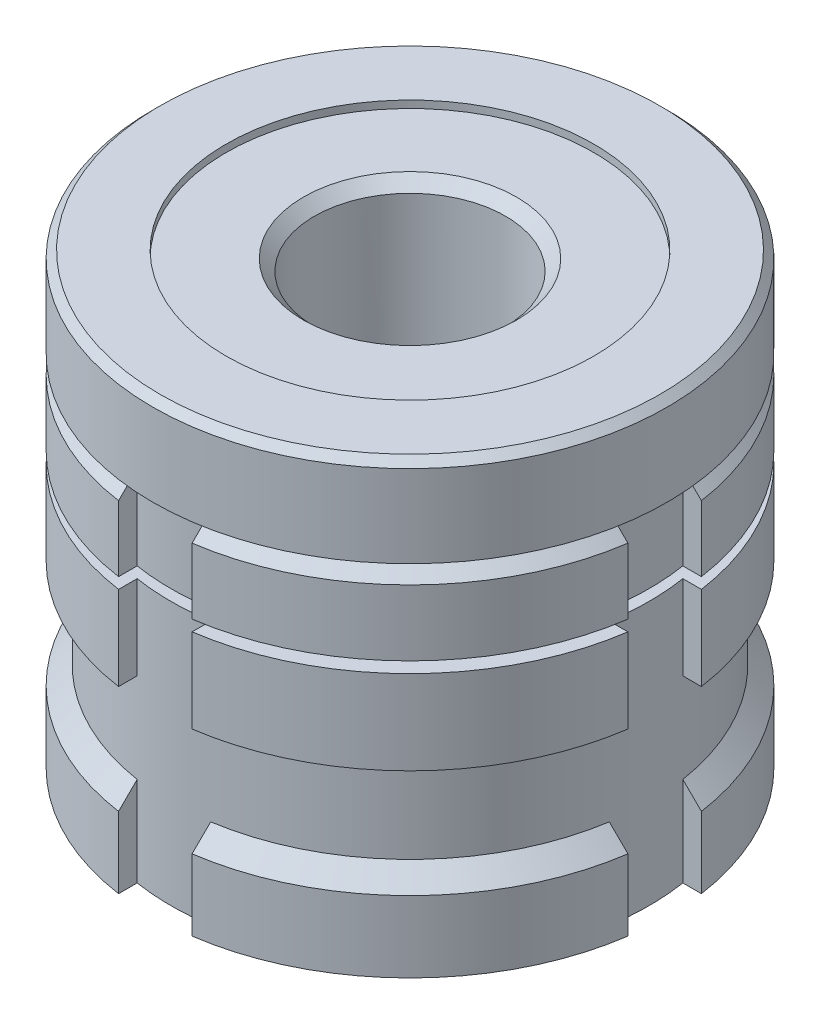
ISO-10303-21;
HEADER;
FILE_DESCRIPTION(('STEP AP214'),'2;1');
FILE_NAME('part.step','',(''),(''),'','','');
FILE_SCHEMA(('AUTOMOTIVE_DESIGN { 1 0 10303 214 1 1 1 1 }'));
ENDSEC;
DATA;
#1=APPLICATION_CONTEXT('core data for automotive mechanical design processes');
#2=APPLICATION_PROTOCOL_DEFINITION('international standard','automotive_design',2000,#1);
#3=PRODUCT_CONTEXT('',#1,'mechanical');
#4=PRODUCT('Part','Part','',(#3));
#5=PRODUCT_RELATED_PRODUCT_CATEGORY('part','',(#4));
#6=PRODUCT_DEFINITION_FORMATION('','',#4);
#7=PRODUCT_DEFINITION_CONTEXT('part definition',#1,'design');
#8=PRODUCT_DEFINITION('design','',#6,#7);
#9=PRODUCT_DEFINITION_SHAPE('','',#8);
#10=(LENGTH_UNIT() NAMED_UNIT(*) SI_UNIT(.MILLI.,.METRE.));
#11=(NAMED_UNIT(*) PLANE_ANGLE_UNIT() SI_UNIT($,.RADIAN.));
#12=(NAMED_UNIT(*) SI_UNIT($,.STERADIAN.) SOLID_ANGLE_UNIT());
#13=UNCERTAINTY_MEASURE_WITH_UNIT(LENGTH_MEASURE(1.E-05),#10,'distance_accuracy_value','');
#14=(GEOMETRIC_REPRESENTATION_CONTEXT(3) GLOBAL_UNCERTAINTY_ASSIGNED_CONTEXT((#13)) GLOBAL_UNIT_ASSIGNED_CONTEXT((#10,
#11,#12)) REPRESENTATION_CONTEXT('',''));
#15=CARTESIAN_POINT('',(0.,0.,0.));
#16=DIRECTION('',(0.,0.,1.));
#17=DIRECTION('',(1.,0.,0.));
#18=AXIS2_PLACEMENT_3D('',#15,#16,#17);
#19=CARTESIAN_POINT('',(0.,24.4,0.));
#20=DIRECTION('',(0.,-1.,0.));
#21=DIRECTION('',(0.,0.,-1.));
#22=AXIS2_PLACEMENT_3D('',#19,#20,#21);
#23=CYLINDRICAL_SURFACE('',#22,35.);
#24=DIRECTION('',(0.,1.,0.));
#25=VECTOR('',#24,1.);
#26=CARTESIAN_POINT('',(-4.99999999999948,-34.8083763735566,34.6410161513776));
#27=LINE('',#26,#25);
#28=CARTESIAN_POINT('',(-4.99999999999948,12.95,34.6410161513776));
#29=VERTEX_POINT('',#28);
#30=CARTESIAN_POINT('',(-4.99999999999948,21.9,34.6410161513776));
#31=VERTEX_POINT('',#30);
#32=EDGE_CURVE('E629',#29,#31,#27,.T.);
#33=ORIENTED_EDGE('',*,*,#32,.T.);
#34=CARTESIAN_POINT('',(0.,21.9,0.));
#35=DIRECTION('',(0.,1.,0.));
#36=DIRECTION('',(0.,0.,1.));
#37=AXIS2_PLACEMENT_3D('',#34,#35,#36);
#38=CIRCLE('',#37,35.);
#39=CARTESIAN_POINT('',(-34.6410161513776,21.9,4.9999999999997));
#40=VERTEX_POINT('',#39);
#41=EDGE_CURVE('E55',#31,#40,#38,.F.);
#42=ORIENTED_EDGE('',*,*,#41,.T.);
#43=DIRECTION('',(0.,1.,0.));
#44=VECTOR('',#43,1.);
#45=CARTESIAN_POINT('',(-34.6410161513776,-34.8083763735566,4.9999999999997));
#46=LINE('',#45,#44);
#47=CARTESIAN_POINT('',(-34.6410161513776,12.95,4.9999999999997));
#48=VERTEX_POINT('',#47);
#49=EDGE_CURVE('E723',#48,#40,#46,.T.);
#50=ORIENTED_EDGE('',*,*,#49,.F.);
#51=CARTESIAN_POINT('',(0.,12.95,0.));
#52=DIRECTION('',(0.,1.,0.));
#53=DIRECTION('',(0.,0.,1.));
#54=AXIS2_PLACEMENT_3D('',#51,#52,#53);
#55=CIRCLE('',#54,35.);
#56=EDGE_CURVE('E631',#48,#29,#55,.T.);
#57=ORIENTED_EDGE('',*,*,#56,.T.);
#58=EDGE_LOOP('',(#33,#42,#50,#57));
#59=FACE_BOUND('',#58,.T.);
#60=ADVANCED_FACE('F39',(#59),#23,.T.);
#61=DIRECTION('',(0.,1.,0.));
#62=VECTOR('',#61,1.);
#63=CARTESIAN_POINT('',(-34.6410161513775,-34.8083763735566,-5.0000000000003));
#64=LINE('',#63,#62);
#65=CARTESIAN_POINT('',(-34.6410161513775,12.95,-5.0000000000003));
#66=VERTEX_POINT('',#65);
#67=CARTESIAN_POINT('',(-34.6410161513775,21.9,-5.0000000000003));
#68=VERTEX_POINT('',#67);
#69=EDGE_CURVE('E714',#66,#68,#64,.T.);
#70=ORIENTED_EDGE('',*,*,#69,.T.);
#71=CARTESIAN_POINT('',(0.,21.9,0.));
#72=DIRECTION('',(0.,1.,0.));
#73=DIRECTION('',(0.,0.,1.));
#74=AXIS2_PLACEMENT_3D('',#71,#72,#73);
#75=CIRCLE('',#74,35.);
#76=CARTESIAN_POINT('',(-4.99999999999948,21.9,-34.6410161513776));
#77=VERTEX_POINT('',#76);
#78=EDGE_CURVE('E409',#68,#77,#75,.F.);
#79=ORIENTED_EDGE('',*,*,#78,.T.);
#80=DIRECTION('',(0.,1.,0.));
#81=VECTOR('',#80,1.);
#82=CARTESIAN_POINT('',(-4.99999999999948,-34.8083763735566,-34.6410161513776));
#83=LINE('',#82,#81);
#84=CARTESIAN_POINT('',(-4.99999999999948,12.95,-34.6410161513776));
#85=VERTEX_POINT('',#84);
#86=EDGE_CURVE('E749',#85,#77,#83,.T.);
#87=ORIENTED_EDGE('',*,*,#86,.F.);
#88=EDGE_CURVE('E1109',#85,#66,#55,.T.);
#89=ORIENTED_EDGE('',*,*,#88,.T.);
#90=EDGE_LOOP('',(#70,#79,#87,#89));
#91=FACE_BOUND('',#90,.T.);
#92=ADVANCED_FACE('F623',(#91),#23,.T.);
#93=DIRECTION('',(0.,1.,0.));
#94=VECTOR('',#93,1.);
#95=CARTESIAN_POINT('',(34.6410161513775,-34.8083763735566,5.00000000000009));
#96=LINE('',#95,#94);
#97=CARTESIAN_POINT('',(34.6410161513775,12.95,5.00000000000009));
#98=VERTEX_POINT('',#97);
#99=CARTESIAN_POINT('',(34.6410161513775,21.9,5.00000000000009));
#100=VERTEX_POINT('',#99);
#101=EDGE_CURVE('E768',#98,#100,#96,.T.);
#102=ORIENTED_EDGE('',*,*,#101,.T.);
#103=CARTESIAN_POINT('',(0.,21.9,0.));
#104=DIRECTION('',(0.,1.,0.));
#105=DIRECTION('',(0.,0.,1.));
#106=AXIS2_PLACEMENT_3D('',#103,#104,#105);
#107=CIRCLE('',#106,35.);
#108=CARTESIAN_POINT('',(4.99999999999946,21.9,34.6410161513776));
#109=VERTEX_POINT('',#108);
#110=EDGE_CURVE('E1118',#100,#109,#107,.F.);
#111=ORIENTED_EDGE('',*,*,#110,.T.);
#112=DIRECTION('',(0.,1.,0.));
#113=VECTOR('',#112,1.);
#114=CARTESIAN_POINT('',(4.99999999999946,-34.8083763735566,34.6410161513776));
#115=LINE('',#114,#113);
#116=CARTESIAN_POINT('',(4.99999999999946,12.95,34.6410161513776));
#117=VERTEX_POINT('',#116);
#118=EDGE_CURVE('E823',#117,#109,#115,.T.);
#119=ORIENTED_EDGE('',*,*,#118,.F.);
#120=EDGE_CURVE('E974',#117,#98,#55,.T.);
#121=ORIENTED_EDGE('',*,*,#120,.T.);
#122=EDGE_LOOP('',(#102,#111,#119,#121));
#123=FACE_BOUND('',#122,.T.);
#124=ADVANCED_FACE('F602',(#123),#23,.T.);
#125=CARTESIAN_POINT('',(0.,12.95,35.));
#126=DIRECTION('',(0.,1.,0.));
#127=DIRECTION('',(0.,0.,1.));
#128=AXIS2_PLACEMENT_3D('',#125,#126,#127);
#129=PLANE('',#128);
#130=CARTESIAN_POINT('',(0.,12.95,0.));
#131=DIRECTION('',(0.,1.,0.));
#132=DIRECTION('',(0.,0.,1.));
#133=AXIS2_PLACEMENT_3D('',#130,#131,#132);
#134=CIRCLE('',#133,25.);
#135=CARTESIAN_POINT('',(0.,12.95,25.));
#136=VERTEX_POINT('',#135);
#137=EDGE_CURVE('E978',#136,#136,#134,.T.);
#138=ORIENTED_EDGE('',*,*,#137,.T.);
#139=EDGE_LOOP('',(#138));
#140=FACE_BOUND('',#139,.T.);
#141=ORIENTED_EDGE('',*,*,#56,.F.);
#142=DIRECTION('',(1.,0.,0.));
#143=VECTOR('',#142,1.);
#144=CARTESIAN_POINT('',(0.,12.95,4.9999999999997));
#145=LINE('',#144,#143);
#146=CARTESIAN_POINT('',(-32.1130814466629,12.95,4.99999999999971));
#147=VERTEX_POINT('',#146);
#148=EDGE_CURVE('E947',#48,#147,#145,.T.);
#149=ORIENTED_EDGE('',*,*,#148,.T.);
#150=CARTESIAN_POINT('',(0.,12.95,0.));
#151=DIRECTION('',(0.,1.,0.));
#152=DIRECTION('',(0.,0.,1.));
#153=AXIS2_PLACEMENT_3D('',#150,#151,#152);
#154=CIRCLE('',#153,32.5);
#155=CARTESIAN_POINT('',(-32.1130814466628,12.95,-5.0000000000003));
#156=VERTEX_POINT('',#155);
#157=EDGE_CURVE('E935',#147,#156,#154,.F.);
#158=ORIENTED_EDGE('',*,*,#157,.T.);
#159=DIRECTION('',(-1.,0.,0.));
#160=VECTOR('',#159,1.);
#161=CARTESIAN_POINT('',(0.,12.95,-5.0000000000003));
#162=LINE('',#161,#160);
#163=EDGE_CURVE('E927',#156,#66,#162,.T.);
#164=ORIENTED_EDGE('',*,*,#163,.T.);
#165=ORIENTED_EDGE('',*,*,#88,.F.);
#166=DIRECTION('',(0.,0.,1.));
#167=VECTOR('',#166,1.);
#168=CARTESIAN_POINT('',(-4.9999999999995,12.95,35.));
#169=LINE('',#168,#167);
#170=CARTESIAN_POINT('',(-4.99999999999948,12.95,-32.1130814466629));
#171=VERTEX_POINT('',#170);
#172=EDGE_CURVE('E915',#85,#171,#169,.T.);
#173=ORIENTED_EDGE('',*,*,#172,.T.);
#174=CARTESIAN_POINT('',(0.,12.95,0.));
#175=DIRECTION('',(0.,1.,0.));
#176=DIRECTION('',(0.,0.,1.));
#177=AXIS2_PLACEMENT_3D('',#174,#175,#176);
#178=CIRCLE('',#177,32.5);
#179=CARTESIAN_POINT('',(4.99999999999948,12.95,-32.1130814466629));
#180=VERTEX_POINT('',#179);
#181=EDGE_CURVE('E905',#171,#180,#178,.F.);
#182=ORIENTED_EDGE('',*,*,#181,.T.);
#183=DIRECTION('',(0.,0.,-1.));
#184=VECTOR('',#183,1.);
#185=CARTESIAN_POINT('',(4.9999999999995,12.95,35.));
#186=LINE('',#185,#184);
#187=CARTESIAN_POINT('',(4.99999999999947,12.95,-34.6410161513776));
#188=VERTEX_POINT('',#187);
#189=EDGE_CURVE('E368',#180,#188,#186,.T.);
#190=ORIENTED_EDGE('',*,*,#189,.T.);
#191=CARTESIAN_POINT('',(34.6410161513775,12.95,-5.0000000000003));
#192=VERTEX_POINT('',#191);
#193=EDGE_CURVE('E979',#192,#188,#55,.T.);
#194=ORIENTED_EDGE('',*,*,#193,.F.);
#195=DIRECTION('',(-1.,0.,0.));
#196=VECTOR('',#195,1.);
#197=CARTESIAN_POINT('',(0.,12.95,-5.0000000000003));
#198=LINE('',#197,#196);
#199=CARTESIAN_POINT('',(32.1130814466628,12.95,-5.0000000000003));
#200=VERTEX_POINT('',#199);
#201=EDGE_CURVE('E876',#192,#200,#198,.T.);
#202=ORIENTED_EDGE('',*,*,#201,.T.);
#203=CARTESIAN_POINT('',(0.,12.95,0.));
#204=DIRECTION('',(0.,1.,0.));
#205=DIRECTION('',(0.,0.,1.));
#206=AXIS2_PLACEMENT_3D('',#203,#204,#205);
#207=CIRCLE('',#206,32.5);
#208=CARTESIAN_POINT('',(32.1130814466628,12.95,5.00000000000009));
#209=VERTEX_POINT('',#208);
#210=EDGE_CURVE('E864',#200,#209,#207,.F.);
#211=ORIENTED_EDGE('',*,*,#210,.T.);
#212=DIRECTION('',(1.,0.,0.));
#213=VECTOR('',#212,1.);
#214=CARTESIAN_POINT('',(0.,12.95,5.0000000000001));
#215=LINE('',#214,#213);
#216=EDGE_CURVE('E888',#209,#98,#215,.T.);
#217=ORIENTED_EDGE('',*,*,#216,.T.);
#218=ORIENTED_EDGE('',*,*,#120,.F.);
#219=DIRECTION('',(0.,0.,-1.));
#220=VECTOR('',#219,1.);
#221=CARTESIAN_POINT('',(4.99999999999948,12.95,35.));
#222=LINE('',#221,#220);
#223=CARTESIAN_POINT('',(4.99999999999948,12.95,32.1130814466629));
#224=VERTEX_POINT('',#223);
#225=EDGE_CURVE('E845',#117,#224,#222,.T.);
#226=ORIENTED_EDGE('',*,*,#225,.T.);
#227=CARTESIAN_POINT('',(0.,12.95,0.));
#228=DIRECTION('',(0.,1.,0.));
#229=DIRECTION('',(0.,0.,1.));
#230=AXIS2_PLACEMENT_3D('',#227,#228,#229);
#231=CIRCLE('',#230,32.5);
#232=CARTESIAN_POINT('',(-4.99999999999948,12.95,32.1130814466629));
#233=VERTEX_POINT('',#232);
#234=EDGE_CURVE('E833',#224,#233,#231,.F.);
#235=ORIENTED_EDGE('',*,*,#234,.T.);
#236=DIRECTION('',(0.,0.,1.));
#237=VECTOR('',#236,1.);
#238=CARTESIAN_POINT('',(-4.99999999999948,12.95,35.));
#239=LINE('',#238,#237);
#240=EDGE_CURVE('E857',#233,#29,#239,.T.);
#241=ORIENTED_EDGE('',*,*,#240,.T.);
#242=EDGE_LOOP('',(#141,#149,#158,#164,#165,#173,#182,#190,#194,#202,#211,#217,#218,#226,#235,#241));
#243=FACE_BOUND('',#242,.T.);
#244=ADVANCED_FACE('F598',(#140,#243),#129,.F.);
#245=CARTESIAN_POINT('',(0.,11.45,35.));
#246=DIRECTION('',(0.,-1.,0.));
#247=DIRECTION('',(0.,0.,-1.));
#248=AXIS2_PLACEMENT_3D('',#245,#246,#247);
#249=PLANE('',#248);
#250=CARTESIAN_POINT('',(0.,11.45,0.));
#251=DIRECTION('',(0.,1.,0.));
#252=DIRECTION('',(0.,0.,1.));
#253=AXIS2_PLACEMENT_3D('',#250,#251,#252);
#254=CIRCLE('',#253,25.);
#255=CARTESIAN_POINT('',(0.,11.45,25.));
#256=VERTEX_POINT('',#255);
#257=EDGE_CURVE('E956',#256,#256,#254,.T.);
#258=ORIENTED_EDGE('',*,*,#257,.F.);
#259=EDGE_LOOP('',(#258));
#260=FACE_BOUND('',#259,.T.);
#261=CARTESIAN_POINT('',(0.,11.45,0.));
#262=DIRECTION('',(0.,-1.,0.));
#263=DIRECTION('',(0.,0.,-1.));
#264=AXIS2_PLACEMENT_3D('',#261,#262,#263);
#265=CIRCLE('',#264,32.5);
#266=CARTESIAN_POINT('',(-32.1130814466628,11.45,-5.0000000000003));
#267=VERTEX_POINT('',#266);
#268=CARTESIAN_POINT('',(-32.1130814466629,11.45,4.99999999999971));
#269=VERTEX_POINT('',#268);
#270=EDGE_CURVE('E931',#267,#269,#265,.F.);
#271=ORIENTED_EDGE('',*,*,#270,.T.);
#272=DIRECTION('',(-1.,0.,0.));
#273=VECTOR('',#272,1.);
#274=CARTESIAN_POINT('',(0.,11.45,4.9999999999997));
#275=LINE('',#274,#273);
#276=CARTESIAN_POINT('',(-34.6410161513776,11.45,4.9999999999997));
#277=VERTEX_POINT('',#276);
#278=EDGE_CURVE('E943',#269,#277,#275,.T.);
#279=ORIENTED_EDGE('',*,*,#278,.T.);
#280=CARTESIAN_POINT('',(0.,11.45,0.));
#281=DIRECTION('',(0.,1.,0.));
#282=DIRECTION('',(0.,0.,1.));
#283=AXIS2_PLACEMENT_3D('',#280,#281,#282);
#284=CIRCLE('',#283,35.);
#285=CARTESIAN_POINT('',(-4.99999999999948,11.45,34.6410161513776));
#286=VERTEX_POINT('',#285);
#287=EDGE_CURVE('E968',#277,#286,#284,.T.);
#288=ORIENTED_EDGE('',*,*,#287,.T.);
#289=DIRECTION('',(0.,0.,-1.));
#290=VECTOR('',#289,1.);
#291=CARTESIAN_POINT('',(-4.99999999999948,11.45,35.));
#292=LINE('',#291,#290);
#293=CARTESIAN_POINT('',(-4.99999999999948,11.45,32.1130814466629));
#294=VERTEX_POINT('',#293);
#295=EDGE_CURVE('E853',#286,#294,#292,.T.);
#296=ORIENTED_EDGE('',*,*,#295,.T.);
#297=CARTESIAN_POINT('',(0.,11.45,0.));
#298=DIRECTION('',(0.,-1.,0.));
#299=DIRECTION('',(0.,0.,-1.));
#300=AXIS2_PLACEMENT_3D('',#297,#298,#299);
#301=CIRCLE('',#300,32.5);
#302=CARTESIAN_POINT('',(4.99999999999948,11.45,32.1130814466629));
#303=VERTEX_POINT('',#302);
#304=EDGE_CURVE('E732',#294,#303,#301,.F.);
#305=ORIENTED_EDGE('',*,*,#304,.T.);
#306=DIRECTION('',(0.,0.,1.));
#307=VECTOR('',#306,1.);
#308=CARTESIAN_POINT('',(4.99999999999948,11.45,35.));
#309=LINE('',#308,#307);
#310=CARTESIAN_POINT('',(4.99999999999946,11.45,34.6410161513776));
#311=VERTEX_POINT('',#310);
#312=EDGE_CURVE('E841',#303,#311,#309,.T.);
#313=ORIENTED_EDGE('',*,*,#312,.T.);
#314=CARTESIAN_POINT('',(34.6410161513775,11.45,5.00000000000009));
#315=VERTEX_POINT('',#314);
#316=EDGE_CURVE('E969',#311,#315,#284,.T.);
#317=ORIENTED_EDGE('',*,*,#316,.T.);
#318=DIRECTION('',(-1.,0.,0.));
#319=VECTOR('',#318,1.);
#320=CARTESIAN_POINT('',(0.,11.45,5.0000000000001));
#321=LINE('',#320,#319);
#322=CARTESIAN_POINT('',(32.1130814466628,11.45,5.00000000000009));
#323=VERTEX_POINT('',#322);
#324=EDGE_CURVE('E884',#315,#323,#321,.T.);
#325=ORIENTED_EDGE('',*,*,#324,.T.);
#326=CARTESIAN_POINT('',(0.,11.45,0.));
#327=DIRECTION('',(0.,-1.,0.));
#328=DIRECTION('',(0.,0.,-1.));
#329=AXIS2_PLACEMENT_3D('',#326,#327,#328);
#330=CIRCLE('',#329,32.5);
#331=CARTESIAN_POINT('',(32.1130814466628,11.45,-5.0000000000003));
#332=VERTEX_POINT('',#331);
#333=EDGE_CURVE('E860',#323,#332,#330,.F.);
#334=ORIENTED_EDGE('',*,*,#333,.T.);
#335=DIRECTION('',(1.,0.,0.));
#336=VECTOR('',#335,1.);
#337=CARTESIAN_POINT('',(0.,11.45,-5.0000000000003));
#338=LINE('',#337,#336);
#339=CARTESIAN_POINT('',(34.6410161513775,11.45,-5.0000000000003));
#340=VERTEX_POINT('',#339);
#341=EDGE_CURVE('E872',#332,#340,#338,.T.);
#342=ORIENTED_EDGE('',*,*,#341,.T.);
#343=CARTESIAN_POINT('',(4.99999999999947,11.45,-34.6410161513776));
#344=VERTEX_POINT('',#343);
#345=EDGE_CURVE('E973',#340,#344,#284,.T.);
#346=ORIENTED_EDGE('',*,*,#345,.T.);
#347=DIRECTION('',(0.,0.,1.));
#348=VECTOR('',#347,1.);
#349=CARTESIAN_POINT('',(4.9999999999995,11.45,35.));
#350=LINE('',#349,#348);
#351=CARTESIAN_POINT('',(4.99999999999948,11.45,-32.1130814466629));
#352=VERTEX_POINT('',#351);
#353=EDGE_CURVE('E896',#344,#352,#350,.T.);
#354=ORIENTED_EDGE('',*,*,#353,.T.);
#355=CARTESIAN_POINT('',(0.,11.45,0.));
#356=DIRECTION('',(0.,-1.,0.));
#357=DIRECTION('',(0.,0.,-1.));
#358=AXIS2_PLACEMENT_3D('',#355,#356,#357);
#359=CIRCLE('',#358,32.5);
#360=CARTESIAN_POINT('',(-4.99999999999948,11.45,-32.1130814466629));
#361=VERTEX_POINT('',#360);
#362=EDGE_CURVE('E901',#352,#361,#359,.F.);
#363=ORIENTED_EDGE('',*,*,#362,.T.);
#364=DIRECTION('',(0.,0.,-1.));
#365=VECTOR('',#364,1.);
#366=CARTESIAN_POINT('',(-4.9999999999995,11.45,35.));
#367=LINE('',#366,#365);
#368=CARTESIAN_POINT('',(-4.99999999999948,11.45,-34.6410161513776));
#369=VERTEX_POINT('',#368);
#370=EDGE_CURVE('E912',#361,#369,#367,.T.);
#371=ORIENTED_EDGE('',*,*,#370,.T.);
#372=CARTESIAN_POINT('',(-34.6410161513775,11.45,-5.0000000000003));
#373=VERTEX_POINT('',#372);
#374=EDGE_CURVE('E1142',#369,#373,#284,.T.);
#375=ORIENTED_EDGE('',*,*,#374,.T.);
#376=DIRECTION('',(1.,0.,0.));
#377=VECTOR('',#376,1.);
#378=CARTESIAN_POINT('',(0.,11.45,-5.0000000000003));
#379=LINE('',#378,#377);
#380=EDGE_CURVE('E923',#373,#267,#379,.T.);
#381=ORIENTED_EDGE('',*,*,#380,.T.);
#382=EDGE_LOOP('',(#271,#279,#288,#296,#305,#313,#317,#325,#334,#342,#346,#354,#363,#371,#375,#381));
#383=FACE_BOUND('',#382,.T.);
#384=ADVANCED_FACE('F594',(#260,#383),#249,.F.);
#385=CARTESIAN_POINT('',(0.,0.,0.));
#386=DIRECTION('',(0.,1.,0.));
#387=DIRECTION('',(0.,0.,1.));
#388=AXIS2_PLACEMENT_3D('',#385,#386,#387);
#389=PLANE('',#388);
#390=CARTESIAN_POINT('',(0.,0.,0.));
#391=DIRECTION('',(0.,1.,0.));
#392=DIRECTION('',(0.,0.,1.));
#393=AXIS2_PLACEMENT_3D('',#390,#391,#392);
#394=CIRCLE('',#393,35.);
#395=CARTESIAN_POINT('',(-34.6410161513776,0.,4.9999999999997));
#396=VERTEX_POINT('',#395);
#397=CARTESIAN_POINT('',(-4.99999999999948,0.,34.6410161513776));
#398=VERTEX_POINT('',#397);
#399=EDGE_CURVE('E983',#396,#398,#394,.T.);
#400=ORIENTED_EDGE('',*,*,#399,.F.);
#401=DIRECTION('',(1.,0.,0.));
#402=VECTOR('',#401,1.);
#403=CARTESIAN_POINT('',(0.,0.,4.9999999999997));
#404=LINE('',#403,#402);
#405=CARTESIAN_POINT('',(-32.1130814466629,0.,4.99999999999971));
#406=VERTEX_POINT('',#405);
#407=EDGE_CURVE('E939',#396,#406,#404,.T.);
#408=ORIENTED_EDGE('',*,*,#407,.T.);
#409=CARTESIAN_POINT('',(0.,0.,0.));
#410=DIRECTION('',(0.,-1.,0.));
#411=DIRECTION('',(0.,0.,-1.));
#412=AXIS2_PLACEMENT_3D('',#409,#410,#411);
#413=CIRCLE('',#412,32.5);
#414=CARTESIAN_POINT('',(-4.99999999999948,0.,32.1130814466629));
#415=VERTEX_POINT('',#414);
#416=EDGE_CURVE('E1075',#415,#406,#413,.T.);
#417=ORIENTED_EDGE('',*,*,#416,.F.);
#418=DIRECTION('',(0.,0.,1.));
#419=VECTOR('',#418,1.);
#420=CARTESIAN_POINT('',(-4.99999999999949,0.,0.));
#421=LINE('',#420,#419);
#422=EDGE_CURVE('E849',#415,#398,#421,.T.);
#423=ORIENTED_EDGE('',*,*,#422,.T.);
#424=EDGE_LOOP('',(#400,#408,#417,#423));
#425=FACE_BOUND('',#424,.T.);
#426=ADVANCED_FACE('F597',(#425),#389,.F.);
#427=CARTESIAN_POINT('',(-32.1130814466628,0.,-5.0000000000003));
#428=VERTEX_POINT('',#427);
#429=CARTESIAN_POINT('',(-4.99999999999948,0.,-32.1130814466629));
#430=VERTEX_POINT('',#429);
#431=EDGE_CURVE('E964',#428,#430,#413,.T.);
#432=ORIENTED_EDGE('',*,*,#431,.F.);
#433=DIRECTION('',(-1.,0.,0.));
#434=VECTOR('',#433,1.);
#435=CARTESIAN_POINT('',(0.,0.,-5.0000000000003));
#436=LINE('',#435,#434);
#437=CARTESIAN_POINT('',(-34.6410161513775,0.,-5.0000000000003));
#438=VERTEX_POINT('',#437);
#439=EDGE_CURVE('E919',#428,#438,#436,.T.);
#440=ORIENTED_EDGE('',*,*,#439,.T.);
#441=CARTESIAN_POINT('',(-4.99999999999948,0.,-34.6410161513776));
#442=VERTEX_POINT('',#441);
#443=EDGE_CURVE('E1078',#442,#438,#394,.T.);
#444=ORIENTED_EDGE('',*,*,#443,.F.);
#445=DIRECTION('',(0.,0.,1.));
#446=VECTOR('',#445,1.);
#447=CARTESIAN_POINT('',(-4.99999999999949,0.,0.));
#448=LINE('',#447,#446);
#449=EDGE_CURVE('E908',#442,#430,#448,.T.);
#450=ORIENTED_EDGE('',*,*,#449,.T.);
#451=EDGE_LOOP('',(#432,#440,#444,#450));
#452=FACE_BOUND('',#451,.T.);
#453=ADVANCED_FACE('F617',(#452),#389,.F.);
#454=CARTESIAN_POINT('',(32.1130814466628,0.,5.00000000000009));
#455=VERTEX_POINT('',#454);
#456=CARTESIAN_POINT('',(4.99999999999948,0.,32.1130814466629));
#457=VERTEX_POINT('',#456);
#458=EDGE_CURVE('E963',#455,#457,#413,.T.);
#459=ORIENTED_EDGE('',*,*,#458,.F.);
#460=DIRECTION('',(1.,0.,0.));
#461=VECTOR('',#460,1.);
#462=CARTESIAN_POINT('',(0.,0.,5.00000000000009));
#463=LINE('',#462,#461);
#464=CARTESIAN_POINT('',(34.6410161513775,0.,5.00000000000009));
#465=VERTEX_POINT('',#464);
#466=EDGE_CURVE('E880',#455,#465,#463,.T.);
#467=ORIENTED_EDGE('',*,*,#466,.T.);
#468=CARTESIAN_POINT('',(4.99999999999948,0.,34.6410161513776));
#469=VERTEX_POINT('',#468);
#470=EDGE_CURVE('E984',#469,#465,#394,.T.);
#471=ORIENTED_EDGE('',*,*,#470,.F.);
#472=DIRECTION('',(0.,0.,-1.));
#473=VECTOR('',#472,1.);
#474=CARTESIAN_POINT('',(4.99999999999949,0.,0.));
#475=LINE('',#474,#473);
#476=EDGE_CURVE('E837',#469,#457,#475,.T.);
#477=ORIENTED_EDGE('',*,*,#476,.T.);
#478=EDGE_LOOP('',(#459,#467,#471,#477));
#479=FACE_BOUND('',#478,.T.);
#480=ADVANCED_FACE('F610',(#479),#389,.F.);
#481=ORIENTED_EDGE('',*,*,#287,.F.);
#482=EDGE_CURVE('E733',#396,#277,#46,.T.);
#483=ORIENTED_EDGE('',*,*,#482,.F.);
#484=ORIENTED_EDGE('',*,*,#399,.T.);
#485=EDGE_CURVE('E635',#398,#286,#27,.T.);
#486=ORIENTED_EDGE('',*,*,#485,.T.);
#487=EDGE_LOOP('',(#481,#483,#484,#486));
#488=FACE_BOUND('',#487,.T.);
#489=ADVANCED_FACE('F620',(#488),#23,.T.);
#490=ORIENTED_EDGE('',*,*,#443,.T.);
#491=EDGE_CURVE('E724',#438,#373,#64,.T.);
#492=ORIENTED_EDGE('',*,*,#491,.T.);
#493=ORIENTED_EDGE('',*,*,#374,.F.);
#494=EDGE_CURVE('E760',#442,#369,#83,.T.);
#495=ORIENTED_EDGE('',*,*,#494,.F.);
#496=EDGE_LOOP('',(#490,#492,#493,#495));
#497=FACE_BOUND('',#496,.T.);
#498=ADVANCED_FACE('F1143',(#497),#23,.T.);
#499=ORIENTED_EDGE('',*,*,#470,.T.);
#500=EDGE_CURVE('E794',#465,#315,#96,.T.);
#501=ORIENTED_EDGE('',*,*,#500,.T.);
#502=ORIENTED_EDGE('',*,*,#316,.F.);
#503=EDGE_CURVE('E822',#469,#311,#115,.T.);
#504=ORIENTED_EDGE('',*,*,#503,.F.);
#505=EDGE_LOOP('',(#499,#501,#502,#504));
#506=FACE_BOUND('',#505,.T.);
#507=ADVANCED_FACE('F1163',(#506),#23,.T.);
#508=CARTESIAN_POINT('',(0.,-12.2,0.));
#509=DIRECTION('',(0.,-1.,0.));
#510=DIRECTION('',(0.,0.,-1.));
#511=AXIS2_PLACEMENT_3D('',#508,#509,#510);
#512=CYLINDRICAL_SURFACE('',#511,35.);
#513=CARTESIAN_POINT('',(-4.99999999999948,-24.4,34.6410161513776));
#514=VERTEX_POINT('',#513);
#515=CARTESIAN_POINT('',(-4.99999999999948,-14.7,34.6410161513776));
#516=VERTEX_POINT('',#515);
#517=EDGE_CURVE('E638',#514,#516,#27,.T.);
#518=ORIENTED_EDGE('',*,*,#517,.T.);
#519=CARTESIAN_POINT('',(0.,-14.7,0.));
#520=DIRECTION('',(0.,-1.,0.));
#521=DIRECTION('',(0.,0.,-1.));
#522=AXIS2_PLACEMENT_3D('',#519,#520,#521);
#523=CIRCLE('',#522,35.);
#524=CARTESIAN_POINT('',(-34.6410161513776,-14.7,4.9999999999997));
#525=VERTEX_POINT('',#524);
#526=EDGE_CURVE('E531',#516,#525,#523,.T.);
#527=ORIENTED_EDGE('',*,*,#526,.T.);
#528=CARTESIAN_POINT('',(-34.6410161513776,-24.4,4.9999999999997));
#529=VERTEX_POINT('',#528);
#530=EDGE_CURVE('E730',#529,#525,#46,.T.);
#531=ORIENTED_EDGE('',*,*,#530,.F.);
#532=CARTESIAN_POINT('',(0.,-24.4,0.));
#533=DIRECTION('',(0.,-1.,0.));
#534=DIRECTION('',(0.,0.,-1.));
#535=AXIS2_PLACEMENT_3D('',#532,#533,#534);
#536=CIRCLE('',#535,35.);
#537=EDGE_CURVE('E689',#514,#529,#536,.T.);
#538=ORIENTED_EDGE('',*,*,#537,.F.);
#539=EDGE_LOOP('',(#518,#527,#531,#538));
#540=FACE_BOUND('',#539,.T.);
#541=ADVANCED_FACE('F583',(#540),#512,.T.);
#542=CARTESIAN_POINT('',(-34.6410161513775,-24.4,-5.0000000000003));
#543=VERTEX_POINT('',#542);
#544=CARTESIAN_POINT('',(-34.6410161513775,-14.7,-5.0000000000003));
#545=VERTEX_POINT('',#544);
#546=EDGE_CURVE('E719',#543,#545,#64,.T.);
#547=ORIENTED_EDGE('',*,*,#546,.T.);
#548=CARTESIAN_POINT('',(0.,-14.7,0.));
#549=DIRECTION('',(0.,-1.,0.));
#550=DIRECTION('',(0.,0.,-1.));
#551=AXIS2_PLACEMENT_3D('',#548,#549,#550);
#552=CIRCLE('',#551,35.);
#553=CARTESIAN_POINT('',(-4.99999999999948,-14.7,-34.6410161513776));
#554=VERTEX_POINT('',#553);
#555=EDGE_CURVE('E992',#545,#554,#552,.T.);
#556=ORIENTED_EDGE('',*,*,#555,.T.);
#557=CARTESIAN_POINT('',(-4.99999999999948,-24.4,-34.6410161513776));
#558=VERTEX_POINT('',#557);
#559=EDGE_CURVE('E707',#558,#554,#83,.T.);
#560=ORIENTED_EDGE('',*,*,#559,.F.);
#561=EDGE_CURVE('E951',#543,#558,#536,.T.);
#562=ORIENTED_EDGE('',*,*,#561,.F.);
#563=EDGE_LOOP('',(#547,#556,#560,#562));
#564=FACE_BOUND('',#563,.T.);
#565=ADVANCED_FACE('F1038',(#564),#512,.T.);
#566=CARTESIAN_POINT('',(34.6410161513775,-24.4,5.00000000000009));
#567=VERTEX_POINT('',#566);
#568=CARTESIAN_POINT('',(34.6410161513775,-14.7,5.00000000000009));
#569=VERTEX_POINT('',#568);
#570=EDGE_CURVE('E790',#567,#569,#96,.T.);
#571=ORIENTED_EDGE('',*,*,#570,.T.);
#572=CARTESIAN_POINT('',(0.,-14.7,0.));
#573=DIRECTION('',(0.,-1.,0.));
#574=DIRECTION('',(0.,0.,-1.));
#575=AXIS2_PLACEMENT_3D('',#572,#573,#574);
#576=CIRCLE('',#575,35.);
#577=CARTESIAN_POINT('',(4.99999999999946,-14.7,34.6410161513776));
#578=VERTEX_POINT('',#577);
#579=EDGE_CURVE('E1104',#569,#578,#576,.T.);
#580=ORIENTED_EDGE('',*,*,#579,.T.);
#581=CARTESIAN_POINT('',(4.99999999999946,-24.4,34.6410161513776));
#582=VERTEX_POINT('',#581);
#583=EDGE_CURVE('E815',#582,#578,#115,.T.);
#584=ORIENTED_EDGE('',*,*,#583,.F.);
#585=EDGE_CURVE('E957',#567,#582,#536,.T.);
#586=ORIENTED_EDGE('',*,*,#585,.F.);
#587=EDGE_LOOP('',(#571,#580,#584,#586));
#588=FACE_BOUND('',#587,.T.);
#589=ADVANCED_FACE('F584',(#588),#512,.T.);
#590=CARTESIAN_POINT('',(0.,-24.4,0.));
#591=DIRECTION('',(0.,-1.,0.));
#592=DIRECTION('',(0.,0.,-1.));
#593=AXIS2_PLACEMENT_3D('',#590,#591,#592);
#594=PLANE('',#593);
#595=CARTESIAN_POINT('',(0.,-24.4,0.));
#596=DIRECTION('',(0.,-1.,0.));
#597=DIRECTION('',(0.,0.,-1.));
#598=AXIS2_PLACEMENT_3D('',#595,#596,#597);
#599=CIRCLE('',#598,14.5);
#600=CARTESIAN_POINT('',(0.,-24.4,-14.5));
#601=VERTEX_POINT('',#600);
#602=EDGE_CURVE('E660',#601,#601,#599,.F.);
#603=ORIENTED_EDGE('',*,*,#602,.T.);
#604=EDGE_LOOP('',(#603));
#605=FACE_BOUND('',#604,.T.);
#606=DIRECTION('',(1.,0.,0.));
#607=VECTOR('',#606,1.);
#608=CARTESIAN_POINT('',(-32.1130814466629,-24.4,4.9999999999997));
#609=LINE('',#608,#607);
#610=CARTESIAN_POINT('',(-32.1130814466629,-24.4,4.99999999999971));
#611=VERTEX_POINT('',#610);
#612=EDGE_CURVE('E684',#529,#611,#609,.T.);
#613=ORIENTED_EDGE('',*,*,#612,.T.);
#614=CARTESIAN_POINT('',(0.,-24.4,0.));
#615=DIRECTION('',(0.,-1.,0.));
#616=DIRECTION('',(0.,0.,-1.));
#617=AXIS2_PLACEMENT_3D('',#614,#615,#616);
#618=CIRCLE('',#617,32.5);
#619=CARTESIAN_POINT('',(-32.1130814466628,-24.4,-5.0000000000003));
#620=VERTEX_POINT('',#619);
#621=EDGE_CURVE('E686',#611,#620,#618,.T.);
#622=ORIENTED_EDGE('',*,*,#621,.T.);
#623=DIRECTION('',(-1.,0.,0.));
#624=VECTOR('',#623,1.);
#625=CARTESIAN_POINT('',(-34.6410161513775,-24.4,-5.0000000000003));
#626=LINE('',#625,#624);
#627=EDGE_CURVE('E711',#620,#543,#626,.T.);
#628=ORIENTED_EDGE('',*,*,#627,.T.);
#629=ORIENTED_EDGE('',*,*,#561,.T.);
#630=DIRECTION('',(0.,0.,1.));
#631=VECTOR('',#630,1.);
#632=CARTESIAN_POINT('',(-4.99999999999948,-24.4,-34.6410161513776));
#633=LINE('',#632,#631);
#634=CARTESIAN_POINT('',(-4.99999999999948,-24.4,-32.1130814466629));
#635=VERTEX_POINT('',#634);
#636=EDGE_CURVE('E359',#558,#635,#633,.T.);
#637=ORIENTED_EDGE('',*,*,#636,.T.);
#638=CARTESIAN_POINT('',(0.,-24.4,0.));
#639=DIRECTION('',(0.,-1.,0.));
#640=DIRECTION('',(0.,0.,-1.));
#641=AXIS2_PLACEMENT_3D('',#638,#639,#640);
#642=CIRCLE('',#641,32.5);
#643=CARTESIAN_POINT('',(4.99999999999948,-24.4,-32.1130814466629));
#644=VERTEX_POINT('',#643);
#645=EDGE_CURVE('E371',#635,#644,#642,.T.);
#646=ORIENTED_EDGE('',*,*,#645,.T.);
#647=DIRECTION('',(0.,0.,-1.));
#648=VECTOR('',#647,1.);
#649=CARTESIAN_POINT('',(4.99999999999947,-24.4,-32.1130814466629));
#650=LINE('',#649,#648);
#651=CARTESIAN_POINT('',(4.99999999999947,-24.4,-34.6410161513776));
#652=VERTEX_POINT('',#651);
#653=EDGE_CURVE('E737',#644,#652,#650,.T.);
#654=ORIENTED_EDGE('',*,*,#653,.T.);
#655=CARTESIAN_POINT('',(34.6410161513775,-24.4,-5.0000000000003));
#656=VERTEX_POINT('',#655);
#657=EDGE_CURVE('E952',#652,#656,#536,.T.);
#658=ORIENTED_EDGE('',*,*,#657,.T.);
#659=DIRECTION('',(-1.,0.,0.));
#660=VECTOR('',#659,1.);
#661=CARTESIAN_POINT('',(32.1130814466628,-24.4,-5.0000000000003));
#662=LINE('',#661,#660);
#663=CARTESIAN_POINT('',(32.1130814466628,-24.4,-5.0000000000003));
#664=VERTEX_POINT('',#663);
#665=EDGE_CURVE('E775',#656,#664,#662,.T.);
#666=ORIENTED_EDGE('',*,*,#665,.T.);
#667=CARTESIAN_POINT('',(0.,-24.4,0.));
#668=DIRECTION('',(0.,-1.,0.));
#669=DIRECTION('',(0.,0.,-1.));
#670=AXIS2_PLACEMENT_3D('',#667,#668,#669);
#671=CIRCLE('',#670,32.5);
#672=CARTESIAN_POINT('',(32.1130814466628,-24.4,5.00000000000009));
#673=VERTEX_POINT('',#672);
#674=EDGE_CURVE('E769',#664,#673,#671,.T.);
#675=ORIENTED_EDGE('',*,*,#674,.T.);
#676=DIRECTION('',(1.,0.,0.));
#677=VECTOR('',#676,1.);
#678=CARTESIAN_POINT('',(34.6410161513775,-24.4,5.00000000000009));
#679=LINE('',#678,#677);
#680=EDGE_CURVE('E763',#673,#567,#679,.T.);
#681=ORIENTED_EDGE('',*,*,#680,.T.);
#682=ORIENTED_EDGE('',*,*,#585,.T.);
#683=DIRECTION('',(0.,0.,-1.));
#684=VECTOR('',#683,1.);
#685=CARTESIAN_POINT('',(4.99999999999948,-24.4,34.6410161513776));
#686=LINE('',#685,#684);
#687=CARTESIAN_POINT('',(4.99999999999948,-24.4,32.1130814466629));
#688=VERTEX_POINT('',#687);
#689=EDGE_CURVE('E810',#582,#688,#686,.T.);
#690=ORIENTED_EDGE('',*,*,#689,.T.);
#691=CARTESIAN_POINT('',(0.,-24.4,0.));
#692=DIRECTION('',(0.,-1.,0.));
#693=DIRECTION('',(0.,0.,-1.));
#694=AXIS2_PLACEMENT_3D('',#691,#692,#693);
#695=CIRCLE('',#694,32.5);
#696=CARTESIAN_POINT('',(-4.99999999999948,-24.4,32.1130814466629));
#697=VERTEX_POINT('',#696);
#698=EDGE_CURVE('E804',#688,#697,#695,.T.);
#699=ORIENTED_EDGE('',*,*,#698,.T.);
#700=DIRECTION('',(0.,0.,1.));
#701=VECTOR('',#700,1.);
#702=CARTESIAN_POINT('',(-4.99999999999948,-24.4,32.1130814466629));
#703=LINE('',#702,#701);
#704=EDGE_CURVE('E636',#697,#514,#703,.T.);
#705=ORIENTED_EDGE('',*,*,#704,.T.);
#706=ORIENTED_EDGE('',*,*,#537,.T.);
#707=EDGE_LOOP('',(#613,#622,#628,#629,#637,#646,#654,#658,#666,#675,#681,#682,#690,#699,#705,#706));
#708=FACE_BOUND('',#707,.T.);
#709=ADVANCED_FACE('F585',(#605,#708),#594,.T.);
#710=CARTESIAN_POINT('',(0.,-24.4,0.));
#711=DIRECTION('',(0.,1.,0.));
#712=DIRECTION('',(0.,0.,1.));
#713=AXIS2_PLACEMENT_3D('',#710,#711,#712);
#714=CYLINDRICAL_SURFACE('',#713,32.5);
#715=DIRECTION('',(0.,1.,0.));
#716=VECTOR('',#715,1.);
#717=CARTESIAN_POINT('',(-32.1130814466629,-34.8083763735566,4.99999999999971));
#718=LINE('',#717,#716);
#719=CARTESIAN_POINT('',(-32.1130814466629,-12.2,4.99999999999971));
#720=VERTEX_POINT('',#719);
#721=EDGE_CURVE('E704',#611,#720,#718,.T.);
#722=ORIENTED_EDGE('',*,*,#721,.T.);
#723=CARTESIAN_POINT('',(0.,-12.2,0.));
#724=DIRECTION('',(0.,-1.,0.));
#725=DIRECTION('',(0.,0.,-1.));
#726=AXIS2_PLACEMENT_3D('',#723,#724,#725);
#727=CIRCLE('',#726,32.5);
#728=CARTESIAN_POINT('',(-4.99999999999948,-12.2,32.1130814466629));
#729=VERTEX_POINT('',#728);
#730=EDGE_CURVE('E1011',#729,#720,#727,.T.);
#731=ORIENTED_EDGE('',*,*,#730,.F.);
#732=DIRECTION('',(0.,1.,0.));
#733=VECTOR('',#732,1.);
#734=CARTESIAN_POINT('',(-4.99999999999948,-34.8083763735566,32.1130814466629));
#735=LINE('',#734,#733);
#736=EDGE_CURVE('E764',#697,#729,#735,.T.);
#737=ORIENTED_EDGE('',*,*,#736,.F.);
#738=ORIENTED_EDGE('',*,*,#698,.F.);
#739=DIRECTION('',(0.,1.,0.));
#740=VECTOR('',#739,1.);
#741=CARTESIAN_POINT('',(4.99999999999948,-34.8083763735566,32.1130814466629));
#742=LINE('',#741,#740);
#743=CARTESIAN_POINT('',(4.99999999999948,-12.2,32.1130814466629));
#744=VERTEX_POINT('',#743);
#745=EDGE_CURVE('E809',#688,#744,#742,.T.);
#746=ORIENTED_EDGE('',*,*,#745,.T.);
#747=CARTESIAN_POINT('',(32.1130814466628,-12.2,5.00000000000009));
#748=VERTEX_POINT('',#747);
#749=EDGE_CURVE('E993',#748,#744,#727,.T.);
#750=ORIENTED_EDGE('',*,*,#749,.F.);
#751=DIRECTION('',(0.,1.,0.));
#752=VECTOR('',#751,1.);
#753=CARTESIAN_POINT('',(32.1130814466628,-34.8083763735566,5.00000000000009));
#754=LINE('',#753,#752);
#755=EDGE_CURVE('E360',#673,#748,#754,.T.);
#756=ORIENTED_EDGE('',*,*,#755,.F.);
#757=ORIENTED_EDGE('',*,*,#674,.F.);
#758=DIRECTION('',(0.,1.,0.));
#759=VECTOR('',#758,1.);
#760=CARTESIAN_POINT('',(32.1130814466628,-34.8083763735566,-5.0000000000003));
#761=LINE('',#760,#759);
#762=CARTESIAN_POINT('',(32.1130814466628,-12.2,-5.0000000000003));
#763=VERTEX_POINT('',#762);
#764=EDGE_CURVE('E774',#664,#763,#761,.T.);
#765=ORIENTED_EDGE('',*,*,#764,.T.);
#766=CARTESIAN_POINT('',(4.99999999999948,-12.2,-32.1130814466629));
#767=VERTEX_POINT('',#766);
#768=EDGE_CURVE('E989',#767,#763,#727,.T.);
#769=ORIENTED_EDGE('',*,*,#768,.F.);
#770=DIRECTION('',(0.,1.,0.));
#771=VECTOR('',#770,1.);
#772=CARTESIAN_POINT('',(4.99999999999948,-34.8083763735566,-32.1130814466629));
#773=LINE('',#772,#771);
#774=EDGE_CURVE('E373',#644,#767,#773,.T.);
#775=ORIENTED_EDGE('',*,*,#774,.F.);
#776=ORIENTED_EDGE('',*,*,#645,.F.);
#777=DIRECTION('',(0.,1.,0.));
#778=VECTOR('',#777,1.);
#779=CARTESIAN_POINT('',(-4.99999999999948,-34.8083763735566,-32.1130814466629));
#780=LINE('',#779,#778);
#781=CARTESIAN_POINT('',(-4.99999999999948,-12.2,-32.1130814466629));
#782=VERTEX_POINT('',#781);
#783=EDGE_CURVE('E745',#635,#782,#780,.T.);
#784=ORIENTED_EDGE('',*,*,#783,.T.);
#785=CARTESIAN_POINT('',(-32.1130814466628,-12.2,-5.0000000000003));
#786=VERTEX_POINT('',#785);
#787=EDGE_CURVE('E962',#786,#782,#727,.T.);
#788=ORIENTED_EDGE('',*,*,#787,.F.);
#789=DIRECTION('',(0.,1.,0.));
#790=VECTOR('',#789,1.);
#791=CARTESIAN_POINT('',(-32.1130814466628,-34.8083763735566,-5.0000000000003));
#792=LINE('',#791,#790);
#793=EDGE_CURVE('E715',#620,#786,#792,.T.);
#794=ORIENTED_EDGE('',*,*,#793,.F.);
#795=ORIENTED_EDGE('',*,*,#621,.F.);
#796=EDGE_LOOP('',(#722,#731,#737,#738,#746,#750,#756,#757,#765,#769,#775,#776,#784,#788,#794,#795));
#797=FACE_BOUND('',#796,.T.);
#798=ORIENTED_EDGE('',*,*,#416,.T.);
#799=EDGE_CURVE('E702',#406,#269,#718,.T.);
#800=ORIENTED_EDGE('',*,*,#799,.T.);
#801=ORIENTED_EDGE('',*,*,#270,.F.);
#802=EDGE_CURVE('E726',#428,#267,#792,.T.);
#803=ORIENTED_EDGE('',*,*,#802,.F.);
#804=ORIENTED_EDGE('',*,*,#431,.T.);
#805=EDGE_CURVE('E756',#430,#361,#780,.T.);
#806=ORIENTED_EDGE('',*,*,#805,.T.);
#807=ORIENTED_EDGE('',*,*,#362,.F.);
#808=CARTESIAN_POINT('',(4.99999999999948,0.,-32.1130814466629));
#809=VERTEX_POINT('',#808);
#810=EDGE_CURVE('E370',#809,#352,#773,.T.);
#811=ORIENTED_EDGE('',*,*,#810,.F.);
#812=CARTESIAN_POINT('',(32.1130814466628,0.,-5.0000000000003));
#813=VERTEX_POINT('',#812);
#814=EDGE_CURVE('E958',#809,#813,#413,.T.);
#815=ORIENTED_EDGE('',*,*,#814,.T.);
#816=EDGE_CURVE('E784',#813,#332,#761,.T.);
#817=ORIENTED_EDGE('',*,*,#816,.T.);
#818=ORIENTED_EDGE('',*,*,#333,.F.);
#819=EDGE_CURVE('E797',#455,#323,#754,.T.);
#820=ORIENTED_EDGE('',*,*,#819,.F.);
#821=ORIENTED_EDGE('',*,*,#458,.T.);
#822=EDGE_CURVE('E819',#457,#303,#742,.T.);
#823=ORIENTED_EDGE('',*,*,#822,.T.);
#824=ORIENTED_EDGE('',*,*,#304,.F.);
#825=EDGE_CURVE('E829',#415,#294,#735,.T.);
#826=ORIENTED_EDGE('',*,*,#825,.F.);
#827=EDGE_LOOP('',(#798,#800,#801,#803,#804,#806,#807,#811,#815,#817,#818,#820,#821,#823,#824,#826));
#828=FACE_BOUND('',#827,.T.);
#829=ADVANCED_FACE('F588',(#797,#828),#714,.T.);
#830=DIRECTION('',(0.,1.,0.));
#831=VECTOR('',#830,1.);
#832=CARTESIAN_POINT('',(4.99999999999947,-34.8083763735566,-34.6410161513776));
#833=LINE('',#832,#831);
#834=CARTESIAN_POINT('',(4.99999999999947,21.9,-34.6410161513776));
#835=VERTEX_POINT('',#834);
#836=EDGE_CURVE('E741',#188,#835,#833,.T.);
#837=ORIENTED_EDGE('',*,*,#836,.T.);
#838=CARTESIAN_POINT('',(0.,21.9,0.));
#839=DIRECTION('',(0.,1.,0.));
#840=DIRECTION('',(0.,0.,1.));
#841=AXIS2_PLACEMENT_3D('',#838,#839,#840);
#842=CIRCLE('',#841,35.);
#843=CARTESIAN_POINT('',(34.6410161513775,21.9,-5.0000000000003));
#844=VERTEX_POINT('',#843);
#845=EDGE_CURVE('E381',#835,#844,#842,.F.);
#846=ORIENTED_EDGE('',*,*,#845,.T.);
#847=DIRECTION('',(0.,1.,0.));
#848=VECTOR('',#847,1.);
#849=CARTESIAN_POINT('',(34.6410161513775,-34.8083763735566,-5.0000000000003));
#850=LINE('',#849,#848);
#851=EDGE_CURVE('E789',#192,#844,#850,.T.);
#852=ORIENTED_EDGE('',*,*,#851,.F.);
#853=ORIENTED_EDGE('',*,*,#193,.T.);
#854=EDGE_LOOP('',(#837,#846,#852,#853));
#855=FACE_BOUND('',#854,.T.);
#856=ADVANCED_FACE('F592',(#855),#23,.T.);
#857=CARTESIAN_POINT('',(0.,13.2647697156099,0.));
#858=DIRECTION('',(0.,1.,0.));
#859=DIRECTION('',(0.,0.,1.));
#860=AXIS2_PLACEMENT_3D('',#857,#858,#859);
#861=CYLINDRICAL_SURFACE('',#860,25.);
#862=ORIENTED_EDGE('',*,*,#137,.F.);
#863=EDGE_LOOP('',(#862));
#864=FACE_BOUND('',#863,.T.);
#865=ORIENTED_EDGE('',*,*,#257,.T.);
#866=EDGE_LOOP('',(#865));
#867=FACE_BOUND('',#866,.T.);
#868=ADVANCED_FACE('F604',(#864,#867),#861,.T.);
#869=ORIENTED_EDGE('',*,*,#814,.F.);
#870=DIRECTION('',(0.,0.,-1.));
#871=VECTOR('',#870,1.);
#872=CARTESIAN_POINT('',(4.99999999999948,0.,0.));
#873=LINE('',#872,#871);
#874=CARTESIAN_POINT('',(4.99999999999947,0.,-34.6410161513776));
#875=VERTEX_POINT('',#874);
#876=EDGE_CURVE('E892',#809,#875,#873,.T.);
#877=ORIENTED_EDGE('',*,*,#876,.T.);
#878=CARTESIAN_POINT('',(34.6410161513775,0.,-5.0000000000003));
#879=VERTEX_POINT('',#878);
#880=EDGE_CURVE('E988',#879,#875,#394,.T.);
#881=ORIENTED_EDGE('',*,*,#880,.F.);
#882=DIRECTION('',(-1.,0.,0.));
#883=VECTOR('',#882,1.);
#884=CARTESIAN_POINT('',(0.,0.,-5.0000000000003));
#885=LINE('',#884,#883);
#886=EDGE_CURVE('E868',#879,#813,#885,.T.);
#887=ORIENTED_EDGE('',*,*,#886,.T.);
#888=EDGE_LOOP('',(#869,#877,#881,#887));
#889=FACE_BOUND('',#888,.T.);
#890=ADVANCED_FACE('F606',(#889),#389,.F.);
#891=ORIENTED_EDGE('',*,*,#880,.T.);
#892=EDGE_CURVE('E750',#875,#344,#833,.T.);
#893=ORIENTED_EDGE('',*,*,#892,.T.);
#894=ORIENTED_EDGE('',*,*,#345,.F.);
#895=EDGE_CURVE('E788',#879,#340,#850,.T.);
#896=ORIENTED_EDGE('',*,*,#895,.F.);
#897=EDGE_LOOP('',(#891,#893,#894,#896));
#898=FACE_BOUND('',#897,.T.);
#899=ADVANCED_FACE('F451',(#898),#23,.T.);
#900=CARTESIAN_POINT('',(4.99999999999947,-14.7,-34.6410161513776));
#901=VERTEX_POINT('',#900);
#902=EDGE_CURVE('E746',#652,#901,#833,.T.);
#903=ORIENTED_EDGE('',*,*,#902,.T.);
#904=CARTESIAN_POINT('',(0.,-14.7,0.));
#905=DIRECTION('',(0.,-1.,0.));
#906=DIRECTION('',(0.,0.,-1.));
#907=AXIS2_PLACEMENT_3D('',#904,#905,#906);
#908=CIRCLE('',#907,35.);
#909=CARTESIAN_POINT('',(34.6410161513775,-14.7,-5.0000000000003));
#910=VERTEX_POINT('',#909);
#911=EDGE_CURVE('E438',#901,#910,#908,.T.);
#912=ORIENTED_EDGE('',*,*,#911,.T.);
#913=EDGE_CURVE('E780',#656,#910,#850,.T.);
#914=ORIENTED_EDGE('',*,*,#913,.F.);
#915=ORIENTED_EDGE('',*,*,#657,.F.);
#916=EDGE_LOOP('',(#903,#912,#914,#915));
#917=FACE_BOUND('',#916,.T.);
#918=ADVANCED_FACE('F577',(#917),#512,.T.);
#919=CARTESIAN_POINT('',(4.99999999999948,-34.8083763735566,34.6410161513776));
#920=DIRECTION('',(1.,0.,0.));
#921=DIRECTION('',(0.,0.,-1.));
#922=AXIS2_PLACEMENT_3D('',#919,#920,#921);
#923=PLANE('',#922);
#924=ORIENTED_EDGE('',*,*,#583,.T.);
#925=CARTESIAN_POINT('',(4.99999999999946,-14.7,34.6410161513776));
#926=CARTESIAN_POINT('',(4.99999999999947,-14.2831580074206,34.2198670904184));
#927=CARTESIAN_POINT('',(4.99999999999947,-13.8664036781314,33.7986313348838));
#928=CARTESIAN_POINT('',(4.99999999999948,-13.0330703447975,32.9559864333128));
#929=CARTESIAN_POINT('',(4.99999999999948,-12.6164913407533,32.5345772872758));
#930=CARTESIAN_POINT('',(4.99999999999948,-12.2,32.1130814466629));
#931=B_SPLINE_CURVE_WITH_KNOTS('',3,(#925,#926,#927,#928,#929,#930),.UNSPECIFIED.,.F.,.F.,(4,2,
4),(0.,1.77767083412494,3.55534167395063),.UNSPECIFIED.);
#932=EDGE_CURVE('E532',#578,#744,#931,.T.);
#933=ORIENTED_EDGE('',*,*,#932,.T.);
#934=ORIENTED_EDGE('',*,*,#745,.F.);
#935=ORIENTED_EDGE('',*,*,#689,.F.);
#936=EDGE_LOOP('',(#924,#933,#934,#935));
#937=FACE_BOUND('',#936,.T.);
#938=ADVANCED_FACE('F581',(#937),#923,.F.);
#939=CARTESIAN_POINT('',(-4.99999999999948,-34.8083763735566,32.1130814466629));
#940=DIRECTION('',(-1.,0.,0.));
#941=DIRECTION('',(0.,0.,1.));
#942=AXIS2_PLACEMENT_3D('',#939,#940,#941);
#943=PLANE('',#942);
#944=ORIENTED_EDGE('',*,*,#736,.T.);
#945=CARTESIAN_POINT('',(-4.99999999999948,-12.2,32.1130814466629));
#946=CARTESIAN_POINT('',(-4.99999999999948,-12.6164913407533,32.5345772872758));
#947=CARTESIAN_POINT('',(-4.99999999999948,-13.0330703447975,32.9559864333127));
#948=CARTESIAN_POINT('',(-4.99999999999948,-13.8664036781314,33.7986313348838));
#949=CARTESIAN_POINT('',(-4.99999999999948,-14.2831580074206,34.2198670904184));
#950=CARTESIAN_POINT('',(-4.99999999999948,-14.7,34.6410161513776));
#951=B_SPLINE_CURVE_WITH_KNOTS('',3,(#945,#946,#947,#948,#949,#950),.UNSPECIFIED.,.F.,.F.,(4,2,
4),(0.,1.77767083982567,3.55534167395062),.UNSPECIFIED.);
#952=EDGE_CURVE('E558',#729,#516,#951,.T.);
#953=ORIENTED_EDGE('',*,*,#952,.T.);
#954=ORIENTED_EDGE('',*,*,#517,.F.);
#955=ORIENTED_EDGE('',*,*,#704,.F.);
#956=EDGE_LOOP('',(#944,#953,#954,#955));
#957=FACE_BOUND('',#956,.T.);
#958=ADVANCED_FACE('F575',(#957),#943,.F.);
#959=CARTESIAN_POINT('',(32.1130814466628,-34.8083763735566,-5.0000000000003));
#960=DIRECTION('',(0.,0.,-1.));
#961=DIRECTION('',(-1.,0.,0.));
#962=AXIS2_PLACEMENT_3D('',#959,#960,#961);
#963=PLANE('',#962);
#964=ORIENTED_EDGE('',*,*,#913,.T.);
#965=CARTESIAN_POINT('',(34.6410161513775,-14.7,-5.0000000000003));
#966=CARTESIAN_POINT('',(34.2198670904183,-14.2831580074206,-5.0000000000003));
#967=CARTESIAN_POINT('',(33.7986313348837,-13.8664036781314,-5.0000000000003));
#968=CARTESIAN_POINT('',(32.9559864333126,-13.0330703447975,-5.0000000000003));
#969=CARTESIAN_POINT('',(32.5345772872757,-12.6164913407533,-5.0000000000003));
#970=CARTESIAN_POINT('',(32.1130814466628,-12.2,-5.0000000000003));
#971=B_SPLINE_CURVE_WITH_KNOTS('',3,(#965,#966,#967,#968,#969,#970),.UNSPECIFIED.,.F.,.F.,(4,2,
4),(0.,1.77767083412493,3.55534167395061),.UNSPECIFIED.);
#972=EDGE_CURVE('E458',#910,#763,#971,.T.);
#973=ORIENTED_EDGE('',*,*,#972,.T.);
#974=ORIENTED_EDGE('',*,*,#764,.F.);
#975=ORIENTED_EDGE('',*,*,#665,.F.);
#976=EDGE_LOOP('',(#964,#973,#974,#975));
#977=FACE_BOUND('',#976,.T.);
#978=ADVANCED_FACE('F512',(#977),#963,.F.);
#979=CARTESIAN_POINT('',(34.6410161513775,-34.8083763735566,5.00000000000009));
#980=DIRECTION('',(0.,0.,1.));
#981=DIRECTION('',(1.,0.,0.));
#982=AXIS2_PLACEMENT_3D('',#979,#980,#981);
#983=PLANE('',#982);
#984=ORIENTED_EDGE('',*,*,#755,.T.);
#985=CARTESIAN_POINT('',(32.1130814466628,-12.2,5.00000000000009));
#986=CARTESIAN_POINT('',(32.5345772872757,-12.6164913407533,5.00000000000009));
#987=CARTESIAN_POINT('',(32.9559864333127,-13.0330703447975,5.00000000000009));
#988=CARTESIAN_POINT('',(33.7986313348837,-13.8664036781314,5.00000000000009));
#989=CARTESIAN_POINT('',(34.2198670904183,-14.2831580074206,5.00000000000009));
#990=CARTESIAN_POINT('',(34.6410161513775,-14.7,5.00000000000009));
#991=B_SPLINE_CURVE_WITH_KNOTS('',3,(#985,#986,#987,#988,#989,#990),.UNSPECIFIED.,.F.,.F.,(4,2,
4),(0.,1.77767083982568,3.55534167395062),.UNSPECIFIED.);
#992=EDGE_CURVE('E524',#748,#569,#991,.T.);
#993=ORIENTED_EDGE('',*,*,#992,.T.);
#994=ORIENTED_EDGE('',*,*,#570,.F.);
#995=ORIENTED_EDGE('',*,*,#680,.F.);
#996=EDGE_LOOP('',(#984,#993,#994,#995));
#997=FACE_BOUND('',#996,.T.);
#998=ADVANCED_FACE('F520',(#997),#983,.F.);
#999=CARTESIAN_POINT('',(4.99999999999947,-34.8083763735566,-32.1130814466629));
#1000=DIRECTION('',(1.,0.,0.));
#1001=DIRECTION('',(0.,0.,-1.));
#1002=AXIS2_PLACEMENT_3D('',#999,#1000,#1001);
#1003=PLANE('',#1002);
#1004=ORIENTED_EDGE('',*,*,#774,.T.);
#1005=CARTESIAN_POINT('',(4.99999999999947,-12.2,-32.1130814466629));
#1006=CARTESIAN_POINT('',(4.99999999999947,-12.6164913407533,-32.5345772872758));
#1007=CARTESIAN_POINT('',(4.99999999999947,-13.0330703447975,-32.9559864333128));
#1008=CARTESIAN_POINT('',(4.99999999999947,-13.8664036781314,-33.7986313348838));
#1009=CARTESIAN_POINT('',(4.99999999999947,-14.2831580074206,-34.2198670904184));
#1010=CARTESIAN_POINT('',(4.99999999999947,-14.7,-34.6410161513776));
#1011=B_SPLINE_CURVE_WITH_KNOTS('',3,(#1005,#1006,#1007,#1008,#1009,#1010),.UNSPECIFIED.,.F.,
.F.,(4,2,4),(0.,1.77767083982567,3.5553416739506),.UNSPECIFIED.);
#1012=EDGE_CURVE('E464',#767,#901,#1011,.T.);
#1013=ORIENTED_EDGE('',*,*,#1012,.T.);
#1014=ORIENTED_EDGE('',*,*,#902,.F.);
#1015=ORIENTED_EDGE('',*,*,#653,.F.);
#1016=EDGE_LOOP('',(#1004,#1013,#1014,#1015));
#1017=FACE_BOUND('',#1016,.T.);
#1018=ADVANCED_FACE('F474',(#1017),#1003,.F.);
#1019=CARTESIAN_POINT('',(-4.99999999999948,-34.8083763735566,-34.6410161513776));
#1020=DIRECTION('',(-1.,0.,0.));
#1021=DIRECTION('',(0.,0.,1.));
#1022=AXIS2_PLACEMENT_3D('',#1019,#1020,#1021);
#1023=PLANE('',#1022);
#1024=ORIENTED_EDGE('',*,*,#559,.T.);
#1025=CARTESIAN_POINT('',(-4.99999999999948,-14.7,-34.6410161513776));
#1026=CARTESIAN_POINT('',(-4.99999999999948,-14.2831580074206,-34.2198670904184));
#1027=CARTESIAN_POINT('',(-4.99999999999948,-13.8664036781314,-33.7986313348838));
#1028=CARTESIAN_POINT('',(-4.99999999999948,-13.0330703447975,-32.9559864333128));
#1029=CARTESIAN_POINT('',(-4.99999999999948,-12.6164913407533,-32.5345772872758));
#1030=CARTESIAN_POINT('',(-4.99999999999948,-12.2,-32.1130814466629));
#1031=B_SPLINE_CURVE_WITH_KNOTS('',3,(#1025,#1026,#1027,#1028,#1029,#1030),.UNSPECIFIED.,.F.,
.F.,(4,2,4),(0.,1.77767083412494,3.5553416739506),.UNSPECIFIED.);
#1032=EDGE_CURVE('E439',#554,#782,#1031,.T.);
#1033=ORIENTED_EDGE('',*,*,#1032,.T.);
#1034=ORIENTED_EDGE('',*,*,#783,.F.);
#1035=ORIENTED_EDGE('',*,*,#636,.F.);
#1036=EDGE_LOOP('',(#1024,#1033,#1034,#1035));
#1037=FACE_BOUND('',#1036,.T.);
#1038=ADVANCED_FACE('F1003',(#1037),#1023,.F.);
#1039=CARTESIAN_POINT('',(-34.6410161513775,-34.8083763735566,-5.0000000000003));
#1040=DIRECTION('',(0.,0.,-1.));
#1041=DIRECTION('',(-1.,0.,0.));
#1042=AXIS2_PLACEMENT_3D('',#1039,#1040,#1041);
#1043=PLANE('',#1042);
#1044=ORIENTED_EDGE('',*,*,#793,.T.);
#1045=CARTESIAN_POINT('',(-32.1130814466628,-12.2,-5.0000000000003));
#1046=CARTESIAN_POINT('',(-32.5345772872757,-12.6164913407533,-5.0000000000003));
#1047=CARTESIAN_POINT('',(-32.9559864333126,-13.0330703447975,-5.0000000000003));
#1048=CARTESIAN_POINT('',(-33.7986313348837,-13.8664036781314,-5.0000000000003));
#1049=CARTESIAN_POINT('',(-34.2198670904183,-14.2831580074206,-5.0000000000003));
#1050=CARTESIAN_POINT('',(-34.6410161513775,-14.7,-5.0000000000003));
#1051=B_SPLINE_CURVE_WITH_KNOTS('',3,(#1045,#1046,#1047,#1048,#1049,#1050),.UNSPECIFIED.,.F.,
.F.,(4,2,4),(0.,1.77767083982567,3.55534167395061),.UNSPECIFIED.);
#1052=EDGE_CURVE('E430',#786,#545,#1051,.T.);
#1053=ORIENTED_EDGE('',*,*,#1052,.T.);
#1054=ORIENTED_EDGE('',*,*,#546,.F.);
#1055=ORIENTED_EDGE('',*,*,#627,.F.);
#1056=EDGE_LOOP('',(#1044,#1053,#1054,#1055));
#1057=FACE_BOUND('',#1056,.T.);
#1058=ADVANCED_FACE('F424',(#1057),#1043,.F.);
#1059=CARTESIAN_POINT('',(-32.1130814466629,-34.8083763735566,4.9999999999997));
#1060=DIRECTION('',(0.,0.,1.));
#1061=DIRECTION('',(1.,0.,0.));
#1062=AXIS2_PLACEMENT_3D('',#1059,#1060,#1061);
#1063=PLANE('',#1062);
#1064=ORIENTED_EDGE('',*,*,#530,.T.);
#1065=CARTESIAN_POINT('',(-34.6410161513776,-14.7,4.9999999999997));
#1066=CARTESIAN_POINT('',(-34.2198670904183,-14.2831580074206,4.9999999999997));
#1067=CARTESIAN_POINT('',(-33.7986313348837,-13.8664036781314,4.9999999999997));
#1068=CARTESIAN_POINT('',(-32.9559864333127,-13.0330703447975,4.9999999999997));
#1069=CARTESIAN_POINT('',(-32.5345772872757,-12.6164913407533,4.9999999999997));
#1070=CARTESIAN_POINT('',(-32.1130814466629,-12.2,4.9999999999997));
#1071=B_SPLINE_CURVE_WITH_KNOTS('',3,(#1065,#1066,#1067,#1068,#1069,#1070),.UNSPECIFIED.,.F.,
.F.,(4,2,4),(0.,1.77767083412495,3.55534167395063),.UNSPECIFIED.);
#1072=EDGE_CURVE('E553',#525,#720,#1071,.T.);
#1073=ORIENTED_EDGE('',*,*,#1072,.T.);
#1074=ORIENTED_EDGE('',*,*,#721,.F.);
#1075=ORIENTED_EDGE('',*,*,#612,.F.);
#1076=EDGE_LOOP('',(#1064,#1073,#1074,#1075));
#1077=FACE_BOUND('',#1076,.T.);
#1078=ADVANCED_FACE('F1040',(#1077),#1063,.F.);
#1079=ORIENTED_EDGE('',*,*,#822,.F.);
#1080=ORIENTED_EDGE('',*,*,#476,.F.);
#1081=ORIENTED_EDGE('',*,*,#503,.T.);
#1082=ORIENTED_EDGE('',*,*,#312,.F.);
#1083=EDGE_LOOP('',(#1079,#1080,#1081,#1082));
#1084=FACE_BOUND('',#1083,.T.);
#1085=ADVANCED_FACE('F1055',(#1084),#923,.F.);
#1086=ORIENTED_EDGE('',*,*,#485,.F.);
#1087=ORIENTED_EDGE('',*,*,#422,.F.);
#1088=ORIENTED_EDGE('',*,*,#825,.T.);
#1089=ORIENTED_EDGE('',*,*,#295,.F.);
#1090=EDGE_LOOP('',(#1086,#1087,#1088,#1089));
#1091=FACE_BOUND('',#1090,.T.);
#1092=ADVANCED_FACE('F574',(#1091),#943,.F.);
#1093=ORIENTED_EDGE('',*,*,#816,.F.);
#1094=ORIENTED_EDGE('',*,*,#886,.F.);
#1095=ORIENTED_EDGE('',*,*,#895,.T.);
#1096=ORIENTED_EDGE('',*,*,#341,.F.);
#1097=EDGE_LOOP('',(#1093,#1094,#1095,#1096));
#1098=FACE_BOUND('',#1097,.T.);
#1099=ADVANCED_FACE('F511',(#1098),#963,.F.);
#1100=ORIENTED_EDGE('',*,*,#500,.F.);
#1101=ORIENTED_EDGE('',*,*,#466,.F.);
#1102=ORIENTED_EDGE('',*,*,#819,.T.);
#1103=ORIENTED_EDGE('',*,*,#324,.F.);
#1104=EDGE_LOOP('',(#1100,#1101,#1102,#1103));
#1105=FACE_BOUND('',#1104,.T.);
#1106=ADVANCED_FACE('F519',(#1105),#983,.F.);
#1107=ORIENTED_EDGE('',*,*,#805,.F.);
#1108=ORIENTED_EDGE('',*,*,#449,.F.);
#1109=ORIENTED_EDGE('',*,*,#494,.T.);
#1110=ORIENTED_EDGE('',*,*,#370,.F.);
#1111=EDGE_LOOP('',(#1107,#1108,#1109,#1110));
#1112=FACE_BOUND('',#1111,.T.);
#1113=ADVANCED_FACE('F1138',(#1112),#1023,.F.);
#1114=ORIENTED_EDGE('',*,*,#892,.F.);
#1115=ORIENTED_EDGE('',*,*,#876,.F.);
#1116=ORIENTED_EDGE('',*,*,#810,.T.);
#1117=ORIENTED_EDGE('',*,*,#353,.F.);
#1118=EDGE_LOOP('',(#1114,#1115,#1116,#1117));
#1119=FACE_BOUND('',#1118,.T.);
#1120=ADVANCED_FACE('F473',(#1119),#1003,.F.);
#1121=ORIENTED_EDGE('',*,*,#799,.F.);
#1122=ORIENTED_EDGE('',*,*,#407,.F.);
#1123=ORIENTED_EDGE('',*,*,#482,.T.);
#1124=ORIENTED_EDGE('',*,*,#278,.F.);
#1125=EDGE_LOOP('',(#1121,#1122,#1123,#1124));
#1126=FACE_BOUND('',#1125,.T.);
#1127=ADVANCED_FACE('F1148',(#1126),#1063,.F.);
#1128=ORIENTED_EDGE('',*,*,#491,.F.);
#1129=ORIENTED_EDGE('',*,*,#439,.F.);
#1130=ORIENTED_EDGE('',*,*,#802,.T.);
#1131=ORIENTED_EDGE('',*,*,#380,.F.);
#1132=EDGE_LOOP('',(#1128,#1129,#1130,#1131));
#1133=FACE_BOUND('',#1132,.T.);
#1134=ADVANCED_FACE('F423',(#1133),#1043,.F.);
#1135=CARTESIAN_POINT('',(-4.99999999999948,24.4,32.1130814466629));
#1136=VERTEX_POINT('',#1135);
#1137=EDGE_CURVE('E808',#233,#1136,#735,.T.);
#1138=ORIENTED_EDGE('',*,*,#1137,.T.);
#1139=CARTESIAN_POINT('',(-4.99999999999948,24.4,32.1130814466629));
#1140=CARTESIAN_POINT('',(-4.99999999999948,23.9835086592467,32.5345772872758));
#1141=CARTESIAN_POINT('',(-4.99999999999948,23.5669296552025,32.9559864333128));
#1142=CARTESIAN_POINT('',(-4.99999999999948,22.7335963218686,33.7986313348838));
#1143=CARTESIAN_POINT('',(-4.99999999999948,22.3168419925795,34.2198670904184));
#1144=CARTESIAN_POINT('',(-4.99999999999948,21.9,34.6410161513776));
#1145=B_SPLINE_CURVE_WITH_KNOTS('',3,(#1139,#1140,#1141,#1142,#1143,#1144),.UNSPECIFIED.,.F.,
.F.,(4,2,4),(0.,1.77767083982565,3.55534167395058),.UNSPECIFIED.);
#1146=EDGE_CURVE('E63',#1136,#31,#1145,.T.);
#1147=ORIENTED_EDGE('',*,*,#1146,.T.);
#1148=ORIENTED_EDGE('',*,*,#32,.F.);
#1149=ORIENTED_EDGE('',*,*,#240,.F.);
#1150=EDGE_LOOP('',(#1138,#1147,#1148,#1149));
#1151=FACE_BOUND('',#1150,.T.);
#1152=ADVANCED_FACE('F569',(#1151),#943,.F.);
#1153=ORIENTED_EDGE('',*,*,#118,.T.);
#1154=CARTESIAN_POINT('',(4.99999999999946,21.9,34.6410161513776));
#1155=CARTESIAN_POINT('',(4.99999999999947,22.3168419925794,34.2198670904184));
#1156=CARTESIAN_POINT('',(4.99999999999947,22.7335963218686,33.7986313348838));
#1157=CARTESIAN_POINT('',(4.99999999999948,23.5669296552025,32.9559864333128));
#1158=CARTESIAN_POINT('',(4.99999999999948,23.9835086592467,32.5345772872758));
#1159=CARTESIAN_POINT('',(4.99999999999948,24.4,32.1130814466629));
#1160=B_SPLINE_CURVE_WITH_KNOTS('',3,(#1154,#1155,#1156,#1157,#1158,#1159),.UNSPECIFIED.,.F.,
.F.,(4,2,4),(0.,1.77767083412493,3.55534167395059),.UNSPECIFIED.);
#1161=CARTESIAN_POINT('',(4.99999999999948,24.4,32.1130814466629));
#1162=VERTEX_POINT('',#1161);
#1163=EDGE_CURVE('E1116',#109,#1162,#1160,.T.);
#1164=ORIENTED_EDGE('',*,*,#1163,.T.);
#1165=EDGE_CURVE('E814',#224,#1162,#742,.T.);
#1166=ORIENTED_EDGE('',*,*,#1165,.F.);
#1167=ORIENTED_EDGE('',*,*,#225,.F.);
#1168=EDGE_LOOP('',(#1153,#1164,#1166,#1167));
#1169=FACE_BOUND('',#1168,.T.);
#1170=ADVANCED_FACE('F573',(#1169),#923,.F.);
#1171=CARTESIAN_POINT('',(0.,-34.8083763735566,0.));
#1172=DIRECTION('',(0.,1.,0.));
#1173=DIRECTION('',(0.,0.,1.));
#1174=AXIS2_PLACEMENT_3D('',#1171,#1172,#1173);
#1175=CYLINDRICAL_SURFACE('',#1174,32.5);
#1176=ORIENTED_EDGE('',*,*,#1165,.T.);
#1177=CARTESIAN_POINT('',(0.,24.4,0.));
#1178=DIRECTION('',(0.,-1.,0.));
#1179=DIRECTION('',(0.,0.,1.));
#1180=AXIS2_PLACEMENT_3D('',#1177,#1178,#1179);
#1181=CIRCLE('',#1180,32.5);
#1182=EDGE_CURVE('E798',#1162,#1136,#1181,.T.);
#1183=ORIENTED_EDGE('',*,*,#1182,.T.);
#1184=ORIENTED_EDGE('',*,*,#1137,.F.);
#1185=ORIENTED_EDGE('',*,*,#234,.F.);
#1186=EDGE_LOOP('',(#1176,#1183,#1184,#1185));
#1187=FACE_BOUND('',#1186,.T.);
#1188=ADVANCED_FACE('F517',(#1187),#1175,.T.);
#1189=CARTESIAN_POINT('',(32.1130814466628,24.4,5.00000000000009));
#1190=VERTEX_POINT('',#1189);
#1191=EDGE_CURVE('E773',#209,#1190,#754,.T.);
#1192=ORIENTED_EDGE('',*,*,#1191,.T.);
#1193=CARTESIAN_POINT('',(32.1130814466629,24.4,5.00000000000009));
#1194=CARTESIAN_POINT('',(32.5345772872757,23.9835086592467,5.00000000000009));
#1195=CARTESIAN_POINT('',(32.9559864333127,23.5669296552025,5.00000000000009));
#1196=CARTESIAN_POINT('',(33.7986313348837,22.7335963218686,5.00000000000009));
#1197=CARTESIAN_POINT('',(34.2198670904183,22.3168419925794,5.00000000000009));
#1198=CARTESIAN_POINT('',(34.6410161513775,21.9,5.00000000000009));
#1199=B_SPLINE_CURVE_WITH_KNOTS('',3,(#1193,#1194,#1195,#1196,#1197,#1198),.UNSPECIFIED.,.F.,
.F.,(4,2,4),(0.,1.77767083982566,3.55534167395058),.UNSPECIFIED.);
#1200=EDGE_CURVE('E498',#1190,#100,#1199,.T.);
#1201=ORIENTED_EDGE('',*,*,#1200,.T.);
#1202=ORIENTED_EDGE('',*,*,#101,.F.);
#1203=ORIENTED_EDGE('',*,*,#216,.F.);
#1204=EDGE_LOOP('',(#1192,#1201,#1202,#1203));
#1205=FACE_BOUND('',#1204,.T.);
#1206=ADVANCED_FACE('F509',(#1205),#983,.F.);
#1207=ORIENTED_EDGE('',*,*,#851,.T.);
#1208=CARTESIAN_POINT('',(34.6410161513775,21.9,-5.0000000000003));
#1209=CARTESIAN_POINT('',(34.2198670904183,22.3168419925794,-5.0000000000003));
#1210=CARTESIAN_POINT('',(33.7986313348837,22.7335963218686,-5.0000000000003));
#1211=CARTESIAN_POINT('',(32.9559864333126,23.5669296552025,-5.0000000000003));
#1212=CARTESIAN_POINT('',(32.5345772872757,23.9835086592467,-5.0000000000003));
#1213=CARTESIAN_POINT('',(32.1130814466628,24.4,-5.0000000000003));
#1214=B_SPLINE_CURVE_WITH_KNOTS('',3,(#1208,#1209,#1210,#1211,#1212,#1213),.UNSPECIFIED.,.F.,
.F.,(4,2,4),(0.,1.77767083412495,3.55534167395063),.UNSPECIFIED.);
#1215=CARTESIAN_POINT('',(32.1130814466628,24.4,-5.0000000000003));
#1216=VERTEX_POINT('',#1215);
#1217=EDGE_CURVE('E492',#844,#1216,#1214,.T.);
#1218=ORIENTED_EDGE('',*,*,#1217,.T.);
#1219=EDGE_CURVE('E779',#200,#1216,#761,.T.);
#1220=ORIENTED_EDGE('',*,*,#1219,.F.);
#1221=ORIENTED_EDGE('',*,*,#201,.F.);
#1222=EDGE_LOOP('',(#1207,#1218,#1220,#1221));
#1223=FACE_BOUND('',#1222,.T.);
#1224=ADVANCED_FACE('F504',(#1223),#963,.F.);
#1225=CARTESIAN_POINT('',(0.,-34.8083763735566,0.));
#1226=DIRECTION('',(0.,1.,0.));
#1227=DIRECTION('',(0.,0.,1.));
#1228=AXIS2_PLACEMENT_3D('',#1225,#1226,#1227);
#1229=CYLINDRICAL_SURFACE('',#1228,32.5);
#1230=ORIENTED_EDGE('',*,*,#1219,.T.);
#1231=CARTESIAN_POINT('',(0.,24.4,0.));
#1232=DIRECTION('',(0.,-1.,0.));
#1233=DIRECTION('',(0.,0.,1.));
#1234=AXIS2_PLACEMENT_3D('',#1231,#1232,#1233);
#1235=CIRCLE('',#1234,32.5);
#1236=EDGE_CURVE('E388',#1216,#1190,#1235,.T.);
#1237=ORIENTED_EDGE('',*,*,#1236,.T.);
#1238=ORIENTED_EDGE('',*,*,#1191,.F.);
#1239=ORIENTED_EDGE('',*,*,#210,.F.);
#1240=EDGE_LOOP('',(#1230,#1237,#1238,#1239));
#1241=FACE_BOUND('',#1240,.T.);
#1242=ADVANCED_FACE('F508',(#1241),#1229,.T.);
#1243=ORIENTED_EDGE('',*,*,#86,.T.);
#1244=CARTESIAN_POINT('',(-4.99999999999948,21.9,-34.6410161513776));
#1245=CARTESIAN_POINT('',(-4.99999999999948,22.3168419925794,-34.2198670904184));
#1246=CARTESIAN_POINT('',(-4.99999999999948,22.7335963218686,-33.7986313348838));
#1247=CARTESIAN_POINT('',(-4.99999999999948,23.5669296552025,-32.9559864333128));
#1248=CARTESIAN_POINT('',(-4.99999999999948,23.9835086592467,-32.5345772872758));
#1249=CARTESIAN_POINT('',(-4.99999999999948,24.4,-32.1130814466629));
#1250=B_SPLINE_CURVE_WITH_KNOTS('',3,(#1244,#1245,#1246,#1247,#1248,#1249),.UNSPECIFIED.,.F.,
.F.,(4,2,4),(0.,1.77767083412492,3.55534167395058),.UNSPECIFIED.);
#1251=CARTESIAN_POINT('',(-4.99999999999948,24.4,-32.1130814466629));
#1252=VERTEX_POINT('',#1251);
#1253=EDGE_CURVE('E383',#77,#1252,#1250,.T.);
#1254=ORIENTED_EDGE('',*,*,#1253,.T.);
#1255=EDGE_CURVE('E353',#171,#1252,#780,.T.);
#1256=ORIENTED_EDGE('',*,*,#1255,.F.);
#1257=ORIENTED_EDGE('',*,*,#172,.F.);
#1258=EDGE_LOOP('',(#1243,#1254,#1256,#1257));
#1259=FACE_BOUND('',#1258,.T.);
#1260=ADVANCED_FACE('F1132',(#1259),#1023,.F.);
#1261=CARTESIAN_POINT('',(0.,-34.8083763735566,0.));
#1262=DIRECTION('',(0.,1.,0.));
#1263=DIRECTION('',(0.,0.,1.));
#1264=AXIS2_PLACEMENT_3D('',#1261,#1262,#1263);
#1265=CYLINDRICAL_SURFACE('',#1264,32.5);
#1266=ORIENTED_EDGE('',*,*,#1255,.T.);
#1267=CARTESIAN_POINT('',(0.,24.4,0.));
#1268=DIRECTION('',(0.,-1.,0.));
#1269=DIRECTION('',(0.,0.,1.));
#1270=AXIS2_PLACEMENT_3D('',#1267,#1268,#1269);
#1271=CIRCLE('',#1270,32.5);
#1272=CARTESIAN_POINT('',(4.99999999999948,24.4,-32.1130814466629));
#1273=VERTEX_POINT('',#1272);
#1274=EDGE_CURVE('E347',#1252,#1273,#1271,.T.);
#1275=ORIENTED_EDGE('',*,*,#1274,.T.);
#1276=EDGE_CURVE('E350',#180,#1273,#773,.T.);
#1277=ORIENTED_EDGE('',*,*,#1276,.F.);
#1278=ORIENTED_EDGE('',*,*,#181,.F.);
#1279=EDGE_LOOP('',(#1266,#1275,#1277,#1278));
#1280=FACE_BOUND('',#1279,.T.);
#1281=ADVANCED_FACE('F349',(#1280),#1265,.T.);
#1282=ORIENTED_EDGE('',*,*,#1276,.T.);
#1283=CARTESIAN_POINT('',(4.99999999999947,24.4,-32.1130814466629));
#1284=CARTESIAN_POINT('',(4.99999999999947,23.9835086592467,-32.5345772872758));
#1285=CARTESIAN_POINT('',(4.99999999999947,23.5669296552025,-32.9559864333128));
#1286=CARTESIAN_POINT('',(4.99999999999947,22.7335963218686,-33.7986313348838));
#1287=CARTESIAN_POINT('',(4.99999999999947,22.3168419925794,-34.2198670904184));
#1288=CARTESIAN_POINT('',(4.99999999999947,21.9,-34.6410161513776));
#1289=B_SPLINE_CURVE_WITH_KNOTS('',3,(#1283,#1284,#1285,#1286,#1287,#1288),.UNSPECIFIED.,.F.,
.F.,(4,2,4),(0.,1.77767083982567,3.55534167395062),.UNSPECIFIED.);
#1290=EDGE_CURVE('E365',#1273,#835,#1289,.T.);
#1291=ORIENTED_EDGE('',*,*,#1290,.T.);
#1292=ORIENTED_EDGE('',*,*,#836,.F.);
#1293=ORIENTED_EDGE('',*,*,#189,.F.);
#1294=EDGE_LOOP('',(#1282,#1291,#1292,#1293));
#1295=FACE_BOUND('',#1294,.T.);
#1296=ADVANCED_FACE('F364',(#1295),#1003,.F.);
#1297=ORIENTED_EDGE('',*,*,#49,.T.);
#1298=CARTESIAN_POINT('',(-34.6410161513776,21.9,4.9999999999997));
#1299=CARTESIAN_POINT('',(-34.2198670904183,22.3168419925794,4.9999999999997));
#1300=CARTESIAN_POINT('',(-33.7986313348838,22.7335963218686,4.9999999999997));
#1301=CARTESIAN_POINT('',(-32.9559864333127,23.5669296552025,4.9999999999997));
#1302=CARTESIAN_POINT('',(-32.5345772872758,23.9835086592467,4.9999999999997));
#1303=CARTESIAN_POINT('',(-32.1130814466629,24.4,4.9999999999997));
#1304=B_SPLINE_CURVE_WITH_KNOTS('',3,(#1298,#1299,#1300,#1301,#1302,#1303),.UNSPECIFIED.,.F.,
.F.,(4,2,4),(0.,1.77767083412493,3.55534167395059),.UNSPECIFIED.);
#1305=CARTESIAN_POINT('',(-32.1130814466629,24.4,4.99999999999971));
#1306=VERTEX_POINT('',#1305);
#1307=EDGE_CURVE('E642',#40,#1306,#1304,.T.);
#1308=ORIENTED_EDGE('',*,*,#1307,.T.);
#1309=EDGE_CURVE('E695',#147,#1306,#718,.T.);
#1310=ORIENTED_EDGE('',*,*,#1309,.F.);
#1311=ORIENTED_EDGE('',*,*,#148,.F.);
#1312=EDGE_LOOP('',(#1297,#1308,#1310,#1311));
#1313=FACE_BOUND('',#1312,.T.);
#1314=ADVANCED_FACE('F472',(#1313),#1063,.F.);
#1315=CARTESIAN_POINT('',(0.,-34.8083763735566,0.));
#1316=DIRECTION('',(0.,1.,0.));
#1317=DIRECTION('',(0.,0.,1.));
#1318=AXIS2_PLACEMENT_3D('',#1315,#1316,#1317);
#1319=CYLINDRICAL_SURFACE('',#1318,32.5);
#1320=ORIENTED_EDGE('',*,*,#1309,.T.);
#1321=CARTESIAN_POINT('',(0.,24.4,0.));
#1322=DIRECTION('',(0.,-1.,0.));
#1323=DIRECTION('',(0.,0.,1.));
#1324=AXIS2_PLACEMENT_3D('',#1321,#1322,#1323);
#1325=CIRCLE('',#1324,32.5);
#1326=CARTESIAN_POINT('',(-32.1130814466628,24.4,-5.0000000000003));
#1327=VERTEX_POINT('',#1326);
#1328=EDGE_CURVE('E696',#1306,#1327,#1325,.T.);
#1329=ORIENTED_EDGE('',*,*,#1328,.T.);
#1330=EDGE_CURVE('E718',#156,#1327,#792,.T.);
#1331=ORIENTED_EDGE('',*,*,#1330,.F.);
#1332=ORIENTED_EDGE('',*,*,#157,.F.);
#1333=EDGE_LOOP('',(#1320,#1329,#1331,#1332));
#1334=FACE_BOUND('',#1333,.T.);
#1335=ADVANCED_FACE('F421',(#1334),#1319,.T.);
#1336=ORIENTED_EDGE('',*,*,#1330,.T.);
#1337=CARTESIAN_POINT('',(-32.1130814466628,24.4,-5.0000000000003));
#1338=CARTESIAN_POINT('',(-32.5345772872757,23.9835086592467,-5.0000000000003));
#1339=CARTESIAN_POINT('',(-32.9559864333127,23.5669296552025,-5.0000000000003));
#1340=CARTESIAN_POINT('',(-33.7986313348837,22.7335963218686,-5.0000000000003));
#1341=CARTESIAN_POINT('',(-34.2198670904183,22.3168419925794,-5.0000000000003));
#1342=CARTESIAN_POINT('',(-34.6410161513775,21.9,-5.0000000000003));
#1343=B_SPLINE_CURVE_WITH_KNOTS('',3,(#1337,#1338,#1339,#1340,#1341,#1342),.UNSPECIFIED.,.F.,
.F.,(4,2,4),(0.,1.77767083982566,3.55534167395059),.UNSPECIFIED.);
#1344=EDGE_CURVE('E395',#1327,#68,#1343,.T.);
#1345=ORIENTED_EDGE('',*,*,#1344,.T.);
#1346=ORIENTED_EDGE('',*,*,#69,.F.);
#1347=ORIENTED_EDGE('',*,*,#163,.F.);
#1348=EDGE_LOOP('',(#1336,#1345,#1346,#1347));
#1349=FACE_BOUND('',#1348,.T.);
#1350=ADVANCED_FACE('F415',(#1349),#1043,.F.);
#1351=CARTESIAN_POINT('',(0.,-14.7,0.));
#1352=DIRECTION('',(0.,-1.,0.));
#1353=DIRECTION('',(0.,0.,-1.));
#1354=AXIS2_PLACEMENT_3D('',#1351,#1352,#1353);
#1355=CONICAL_SURFACE('',#1354,35.,0.785398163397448);
#1356=ORIENTED_EDGE('',*,*,#1052,.F.);
#1357=ORIENTED_EDGE('',*,*,#787,.T.);
#1358=ORIENTED_EDGE('',*,*,#1032,.F.);
#1359=ORIENTED_EDGE('',*,*,#555,.F.);
#1360=EDGE_LOOP('',(#1356,#1357,#1358,#1359));
#1361=FACE_BOUND('',#1360,.T.);
#1362=ADVANCED_FACE('F420',(#1361),#1355,.T.);
#1363=CARTESIAN_POINT('',(0.,-14.7,0.));
#1364=DIRECTION('',(0.,-1.,0.));
#1365=DIRECTION('',(0.,0.,-1.));
#1366=AXIS2_PLACEMENT_3D('',#1363,#1364,#1365);
#1367=CONICAL_SURFACE('',#1366,35.,0.785398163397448);
#1368=ORIENTED_EDGE('',*,*,#1012,.F.);
#1369=ORIENTED_EDGE('',*,*,#768,.T.);
#1370=ORIENTED_EDGE('',*,*,#972,.F.);
#1371=ORIENTED_EDGE('',*,*,#911,.F.);
#1372=EDGE_LOOP('',(#1368,#1369,#1370,#1371));
#1373=FACE_BOUND('',#1372,.T.);
#1374=ADVANCED_FACE('F449',(#1373),#1367,.T.);
#1375=CARTESIAN_POINT('',(0.,24.4,0.));
#1376=DIRECTION('',(0.,-1.,0.));
#1377=DIRECTION('',(0.,0.,-1.));
#1378=AXIS2_PLACEMENT_3D('',#1375,#1376,#1377);
#1379=CONICAL_SURFACE('',#1378,32.5,0.785398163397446);
#1380=ORIENTED_EDGE('',*,*,#1253,.F.);
#1381=ORIENTED_EDGE('',*,*,#78,.F.);
#1382=ORIENTED_EDGE('',*,*,#1344,.F.);
#1383=CARTESIAN_POINT('',(0.,24.4,0.));
#1384=DIRECTION('',(0.,1.,0.));
#1385=DIRECTION('',(0.,0.,1.));
#1386=AXIS2_PLACEMENT_3D('',#1383,#1384,#1385);
#1387=CIRCLE('',#1386,32.5);
#1388=EDGE_CURVE('E390',#1252,#1327,#1387,.T.);
#1389=ORIENTED_EDGE('',*,*,#1388,.F.);
#1390=EDGE_LOOP('',(#1380,#1381,#1382,#1389));
#1391=FACE_BOUND('',#1390,.T.);
#1392=ADVANCED_FACE('F411',(#1391),#1379,.T.);
#1393=CARTESIAN_POINT('',(0.,24.4,0.));
#1394=DIRECTION('',(0.,-1.,0.));
#1395=DIRECTION('',(0.,0.,-1.));
#1396=AXIS2_PLACEMENT_3D('',#1393,#1394,#1395);
#1397=CONICAL_SURFACE('',#1396,32.5,0.785398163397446);
#1398=ORIENTED_EDGE('',*,*,#1217,.F.);
#1399=ORIENTED_EDGE('',*,*,#845,.F.);
#1400=ORIENTED_EDGE('',*,*,#1290,.F.);
#1401=CARTESIAN_POINT('',(0.,24.4,0.));
#1402=DIRECTION('',(0.,1.,0.));
#1403=DIRECTION('',(0.,0.,1.));
#1404=AXIS2_PLACEMENT_3D('',#1401,#1402,#1403);
#1405=CIRCLE('',#1404,32.5);
#1406=EDGE_CURVE('E379',#1216,#1273,#1405,.T.);
#1407=ORIENTED_EDGE('',*,*,#1406,.F.);
#1408=EDGE_LOOP('',(#1398,#1399,#1400,#1407));
#1409=FACE_BOUND('',#1408,.T.);
#1410=ADVANCED_FACE('F378',(#1409),#1397,.T.);
#1411=CARTESIAN_POINT('',(0.,24.4,0.));
#1412=DIRECTION('',(0.,-1.,0.));
#1413=DIRECTION('',(0.,0.,-1.));
#1414=AXIS2_PLACEMENT_3D('',#1411,#1412,#1413);
#1415=CONICAL_SURFACE('',#1414,32.5,0.785398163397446);
#1416=ORIENTED_EDGE('',*,*,#1163,.F.);
#1417=ORIENTED_EDGE('',*,*,#110,.F.);
#1418=ORIENTED_EDGE('',*,*,#1200,.F.);
#1419=CARTESIAN_POINT('',(0.,24.4,0.));
#1420=DIRECTION('',(0.,1.,0.));
#1421=DIRECTION('',(0.,0.,1.));
#1422=AXIS2_PLACEMENT_3D('',#1419,#1420,#1421);
#1423=CIRCLE('',#1422,32.5);
#1424=EDGE_CURVE('E391',#1162,#1190,#1423,.T.);
#1425=ORIENTED_EDGE('',*,*,#1424,.F.);
#1426=EDGE_LOOP('',(#1416,#1417,#1418,#1425));
#1427=FACE_BOUND('',#1426,.T.);
#1428=ADVANCED_FACE('F488',(#1427),#1415,.T.);
#1429=CARTESIAN_POINT('',(0.,-14.7,0.));
#1430=DIRECTION('',(0.,-1.,0.));
#1431=DIRECTION('',(0.,0.,-1.));
#1432=AXIS2_PLACEMENT_3D('',#1429,#1430,#1431);
#1433=CONICAL_SURFACE('',#1432,35.,0.78539816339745);
#1434=ORIENTED_EDGE('',*,*,#992,.F.);
#1435=ORIENTED_EDGE('',*,*,#749,.T.);
#1436=ORIENTED_EDGE('',*,*,#932,.F.);
#1437=ORIENTED_EDGE('',*,*,#579,.F.);
#1438=EDGE_LOOP('',(#1434,#1435,#1436,#1437));
#1439=FACE_BOUND('',#1438,.T.);
#1440=ADVANCED_FACE('F538',(#1439),#1433,.T.);
#1441=CARTESIAN_POINT('',(0.,-14.7,0.));
#1442=DIRECTION('',(0.,-1.,0.));
#1443=DIRECTION('',(0.,0.,-1.));
#1444=AXIS2_PLACEMENT_3D('',#1441,#1442,#1443);
#1445=CONICAL_SURFACE('',#1444,35.,0.78539816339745);
#1446=ORIENTED_EDGE('',*,*,#952,.F.);
#1447=ORIENTED_EDGE('',*,*,#730,.T.);
#1448=ORIENTED_EDGE('',*,*,#1072,.F.);
#1449=ORIENTED_EDGE('',*,*,#526,.F.);
#1450=EDGE_LOOP('',(#1446,#1447,#1448,#1449));
#1451=FACE_BOUND('',#1450,.T.);
#1452=ADVANCED_FACE('F542',(#1451),#1445,.T.);
#1453=CARTESIAN_POINT('',(0.,24.4,0.));
#1454=DIRECTION('',(0.,-1.,0.));
#1455=DIRECTION('',(0.,0.,-1.));
#1456=AXIS2_PLACEMENT_3D('',#1453,#1454,#1455);
#1457=CONICAL_SURFACE('',#1456,32.5,0.785398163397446);
#1458=ORIENTED_EDGE('',*,*,#1307,.F.);
#1459=ORIENTED_EDGE('',*,*,#41,.F.);
#1460=ORIENTED_EDGE('',*,*,#1146,.F.);
#1461=CARTESIAN_POINT('',(0.,24.4,0.));
#1462=DIRECTION('',(0.,1.,0.));
#1463=DIRECTION('',(0.,0.,1.));
#1464=AXIS2_PLACEMENT_3D('',#1461,#1462,#1463);
#1465=CIRCLE('',#1464,32.5);
#1466=EDGE_CURVE('E398',#1306,#1136,#1465,.T.);
#1467=ORIENTED_EDGE('',*,*,#1466,.F.);
#1468=EDGE_LOOP('',(#1458,#1459,#1460,#1467));
#1469=FACE_BOUND('',#1468,.T.);
#1470=ADVANCED_FACE('F548',(#1469),#1457,.T.);
#1471=CARTESIAN_POINT('',(0.,24.4,0.));
#1472=DIRECTION('',(0.,1.,0.));
#1473=DIRECTION('',(0.,0.,1.));
#1474=AXIS2_PLACEMENT_3D('',#1471,#1472,#1473);
#1475=PLANE('',#1474);
#1476=CARTESIAN_POINT('',(0.,24.4,0.));
#1477=DIRECTION('',(0.,1.,0.));
#1478=DIRECTION('',(0.,0.,1.));
#1479=AXIS2_PLACEMENT_3D('',#1476,#1477,#1478);
#1480=CIRCLE('',#1479,35.);
#1481=CARTESIAN_POINT('',(0.,24.4,35.));
#1482=VERTEX_POINT('',#1481);
#1483=EDGE_CURVE('E801',#1482,#1482,#1480,.T.);
#1484=ORIENTED_EDGE('',*,*,#1483,.F.);
#1485=EDGE_LOOP('',(#1484));
#1486=FACE_BOUND('',#1485,.T.);
#1487=ORIENTED_EDGE('',*,*,#1274,.F.);
#1488=ORIENTED_EDGE('',*,*,#1388,.T.);
#1489=ORIENTED_EDGE('',*,*,#1328,.F.);
#1490=ORIENTED_EDGE('',*,*,#1466,.T.);
#1491=ORIENTED_EDGE('',*,*,#1182,.F.);
#1492=ORIENTED_EDGE('',*,*,#1424,.T.);
#1493=ORIENTED_EDGE('',*,*,#1236,.F.);
#1494=ORIENTED_EDGE('',*,*,#1406,.T.);
#1495=EDGE_LOOP('',(#1487,#1488,#1489,#1490,#1491,#1492,#1493,#1494));
#1496=FACE_BOUND('',#1495,.T.);
#1497=ADVANCED_FACE('F385',(#1486,#1496),#1475,.F.);
#1498=CARTESIAN_POINT('',(0.,36.6,0.));
#1499=DIRECTION('',(0.,-1.,0.));
#1500=DIRECTION('',(0.,0.,-1.));
#1501=AXIS2_PLACEMENT_3D('',#1498,#1499,#1500);
#1502=CYLINDRICAL_SURFACE('',#1501,35.);
#1503=CARTESIAN_POINT('',(0.,35.6,0.));
#1504=DIRECTION('',(0.,1.,0.));
#1505=DIRECTION('',(0.,0.,1.));
#1506=AXIS2_PLACEMENT_3D('',#1503,#1504,#1505);
#1507=CIRCLE('',#1506,35.);
#1508=CARTESIAN_POINT('',(0.,35.6,35.));
#1509=VERTEX_POINT('',#1508);
#1510=EDGE_CURVE('E656',#1509,#1509,#1507,.F.);
#1511=ORIENTED_EDGE('',*,*,#1510,.T.);
#1512=EDGE_LOOP('',(#1511));
#1513=FACE_BOUND('',#1512,.T.);
#1514=ORIENTED_EDGE('',*,*,#1483,.T.);
#1515=EDGE_LOOP('',(#1514));
#1516=FACE_BOUND('',#1515,.T.);
#1517=ADVANCED_FACE('F425',(#1513,#1516),#1502,.T.);
#1518=CARTESIAN_POINT('',(0.,36.6,0.));
#1519=DIRECTION('',(0.,1.,0.));
#1520=DIRECTION('',(0.,0.,1.));
#1521=AXIS2_PLACEMENT_3D('',#1518,#1519,#1520);
#1522=PLANE('',#1521);
#1523=CARTESIAN_POINT('',(0.,36.6,0.));
#1524=DIRECTION('',(0.,1.,0.));
#1525=DIRECTION('',(0.,0.,1.));
#1526=AXIS2_PLACEMENT_3D('',#1523,#1524,#1525);
#1527=CIRCLE('',#1526,25.);
#1528=CARTESIAN_POINT('',(0.,36.6,25.));
#1529=VERTEX_POINT('',#1528);
#1530=EDGE_CURVE('E1154',#1529,#1529,#1527,.T.);
#1531=ORIENTED_EDGE('',*,*,#1530,.F.);
#1532=EDGE_LOOP('',(#1531));
#1533=FACE_BOUND('',#1532,.T.);
#1534=CARTESIAN_POINT('',(0.,36.6,0.));
#1535=DIRECTION('',(0.,1.,0.));
#1536=DIRECTION('',(0.,0.,1.));
#1537=AXIS2_PLACEMENT_3D('',#1534,#1535,#1536);
#1538=CIRCLE('',#1537,34.);
#1539=CARTESIAN_POINT('',(0.,36.6,34.));
#1540=VERTEX_POINT('',#1539);
#1541=EDGE_CURVE('E646',#1540,#1540,#1538,.T.);
#1542=ORIENTED_EDGE('',*,*,#1541,.T.);
#1543=EDGE_LOOP('',(#1542));
#1544=FACE_BOUND('',#1543,.T.);
#1545=ADVANCED_FACE('F1255',(#1533,#1544),#1522,.T.);
#1546=CARTESIAN_POINT('',(0.,36.6,0.));
#1547=DIRECTION('',(0.,-1.,0.));
#1548=DIRECTION('',(0.,0.,-1.));
#1549=AXIS2_PLACEMENT_3D('',#1546,#1547,#1548);
#1550=CONICAL_SURFACE('',#1549,34.,0.785398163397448);
#1551=ORIENTED_EDGE('',*,*,#1510,.F.);
#1552=EDGE_LOOP('',(#1551));
#1553=FACE_BOUND('',#1552,.T.);
#1554=ORIENTED_EDGE('',*,*,#1541,.F.);
#1555=EDGE_LOOP('',(#1554));
#1556=FACE_BOUND('',#1555,.T.);
#1557=ADVANCED_FACE('F1258',(#1553,#1556),#1550,.T.);
#1558=CARTESIAN_POINT('',(0.,35.6,0.));
#1559=DIRECTION('',(0.,1.,0.));
#1560=DIRECTION('',(0.,0.,1.));
#1561=AXIS2_PLACEMENT_3D('',#1558,#1559,#1560);
#1562=CYLINDRICAL_SURFACE('',#1561,25.);
#1563=CARTESIAN_POINT('',(0.,35.6,0.));
#1564=DIRECTION('',(0.,1.,0.));
#1565=DIRECTION('',(0.,0.,1.));
#1566=AXIS2_PLACEMENT_3D('',#1563,#1564,#1565);
#1567=CIRCLE('',#1566,25.);
#1568=CARTESIAN_POINT('',(0.,35.6,25.));
#1569=VERTEX_POINT('',#1568);
#1570=EDGE_CURVE('E1152',#1569,#1569,#1567,.T.);
#1571=ORIENTED_EDGE('',*,*,#1570,.F.);
#1572=EDGE_LOOP('',(#1571));
#1573=FACE_BOUND('',#1572,.T.);
#1574=ORIENTED_EDGE('',*,*,#1530,.T.);
#1575=EDGE_LOOP('',(#1574));
#1576=FACE_BOUND('',#1575,.T.);
#1577=ADVANCED_FACE('F1253',(#1573,#1576),#1562,.F.);
#1578=CARTESIAN_POINT('',(0.,35.6,0.));
#1579=DIRECTION('',(0.,1.,0.));
#1580=DIRECTION('',(0.,0.,1.));
#1581=AXIS2_PLACEMENT_3D('',#1578,#1579,#1580);
#1582=PLANE('',#1581);
#1583=CARTESIAN_POINT('',(0.,35.6,0.));
#1584=DIRECTION('',(0.,1.,0.));
#1585=DIRECTION('',(0.,0.,1.));
#1586=AXIS2_PLACEMENT_3D('',#1583,#1584,#1585);
#1587=CIRCLE('',#1586,14.5);
#1588=CARTESIAN_POINT('',(0.,35.6,14.5));
#1589=VERTEX_POINT('',#1588);
#1590=EDGE_CURVE('E11',#1589,#1589,#1587,.F.);
#1591=ORIENTED_EDGE('',*,*,#1590,.T.);
#1592=EDGE_LOOP('',(#1591));
#1593=FACE_BOUND('',#1592,.T.);
#1594=ORIENTED_EDGE('',*,*,#1570,.T.);
#1595=EDGE_LOOP('',(#1594));
#1596=FACE_BOUND('',#1595,.T.);
#1597=ADVANCED_FACE('F1267',(#1593,#1596),#1582,.T.);
#1598=CARTESIAN_POINT('',(0.,-61.1695526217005,0.));
#1599=DIRECTION('',(0.,1.,0.));
#1600=DIRECTION('',(0.,0.,1.));
#1601=AXIS2_PLACEMENT_3D('',#1598,#1599,#1600);
#1602=CYLINDRICAL_SURFACE('',#1601,13.);
#1603=CARTESIAN_POINT('',(0.,-22.9,0.));
#1604=DIRECTION('',(0.,-1.,0.));
#1605=DIRECTION('',(0.,0.,-1.));
#1606=AXIS2_PLACEMENT_3D('',#1603,#1604,#1605);
#1607=CIRCLE('',#1606,13.);
#1608=CARTESIAN_POINT('',(0.,-22.9,-13.));
#1609=VERTEX_POINT('',#1608);
#1610=EDGE_CURVE('E48',#1609,#1609,#1607,.T.);
#1611=ORIENTED_EDGE('',*,*,#1610,.T.);
#1612=EDGE_LOOP('',(#1611));
#1613=FACE_BOUND('',#1612,.T.);
#1614=CARTESIAN_POINT('',(0.,34.1,0.));
#1615=DIRECTION('',(0.,1.,0.));
#1616=DIRECTION('',(0.,0.,1.));
#1617=AXIS2_PLACEMENT_3D('',#1614,#1615,#1616);
#1618=CIRCLE('',#1617,13.);
#1619=CARTESIAN_POINT('',(0.,34.1,13.));
#1620=VERTEX_POINT('',#1619);
#1621=EDGE_CURVE('E664',#1620,#1620,#1618,.T.);
#1622=ORIENTED_EDGE('',*,*,#1621,.T.);
#1623=EDGE_LOOP('',(#1622));
#1624=FACE_BOUND('',#1623,.T.);
#1625=ADVANCED_FACE('F673',(#1613,#1624),#1602,.F.);
#1626=CARTESIAN_POINT('',(0.,-24.4,0.));
#1627=DIRECTION('',(0.,-1.,0.));
#1628=DIRECTION('',(0.,0.,-1.));
#1629=AXIS2_PLACEMENT_3D('',#1626,#1627,#1628);
#1630=CONICAL_SURFACE('',#1629,14.5,0.785398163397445);
#1631=ORIENTED_EDGE('',*,*,#1610,.F.);
#1632=EDGE_LOOP('',(#1631));
#1633=FACE_BOUND('',#1632,.T.);
#1634=ORIENTED_EDGE('',*,*,#602,.F.);
#1635=EDGE_LOOP('',(#1634));
#1636=FACE_BOUND('',#1635,.T.);
#1637=ADVANCED_FACE('F676',(#1633,#1636),#1630,.F.);
#1638=CARTESIAN_POINT('',(0.,34.1,0.));
#1639=DIRECTION('',(0.,1.,0.));
#1640=DIRECTION('',(0.,0.,1.));
#1641=AXIS2_PLACEMENT_3D('',#1638,#1639,#1640);
#1642=CONICAL_SURFACE('',#1641,13.,0.785398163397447);
#1643=ORIENTED_EDGE('',*,*,#1590,.F.);
#1644=EDGE_LOOP('',(#1643));
#1645=FACE_BOUND('',#1644,.T.);
#1646=ORIENTED_EDGE('',*,*,#1621,.F.);
#1647=EDGE_LOOP('',(#1646));
#1648=FACE_BOUND('',#1647,.T.);
#1649=ADVANCED_FACE('F41',(#1645,#1648),#1642,.F.);
#1650=CLOSED_SHELL('',(#60,#92,#124,#244,#384,#426,#453,#480,#489,#498,#507,#541,#565,#589,#709,
#829,#856,#868,#890,#899,#918,#938,#958,#978,#998,#1018,#1038,#1058,#1078,#1085,#1092,#1099,
#1106,#1113,#1120,#1127,#1134,#1152,#1170,#1188,#1206,#1224,#1242,#1260,#1281,#1296,#1314,#1335,
#1350,#1362,#1374,#1392,#1410,#1428,#1440,#1452,#1470,#1497,#1517,#1545,#1557,#1577,#1597,#1625,
#1637,#1649));
#1651=MANIFOLD_SOLID_BREP('B2',#1650);
#1652=ADVANCED_BREP_SHAPE_REPRESENTATION('',(#18,#1651),#14);
#1653=SHAPE_DEFINITION_REPRESENTATION(#9,#1652);
ENDSEC;
END-ISO-10303-21;
